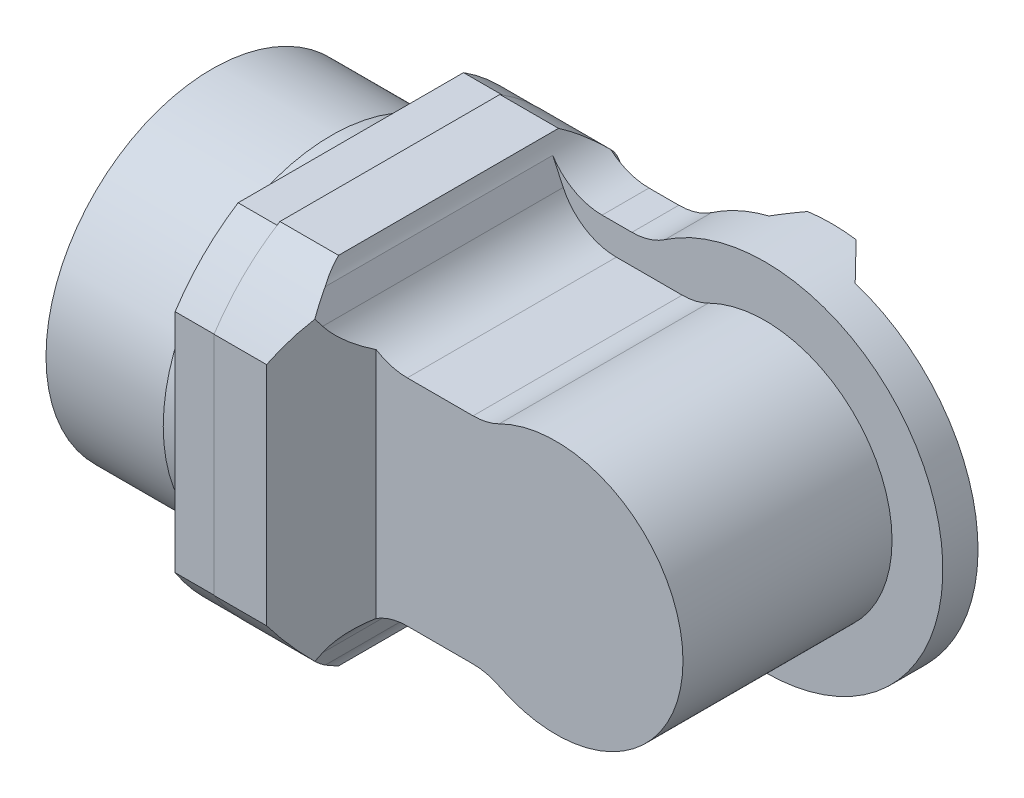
ISO-10303-21;
HEADER;
FILE_DESCRIPTION(('STEP AP214'),'2;1');
FILE_NAME('part.step','',(''),(''),'','','');
FILE_SCHEMA(('AUTOMOTIVE_DESIGN { 1 0 10303 214 1 1 1 1 }'));
ENDSEC;
DATA;
#1=APPLICATION_CONTEXT('core data for automotive mechanical design processes');
#2=APPLICATION_PROTOCOL_DEFINITION('international standard','automotive_design',2000,#1);
#3=PRODUCT_CONTEXT('',#1,'mechanical');
#4=PRODUCT('Part','Part','',(#3));
#5=PRODUCT_RELATED_PRODUCT_CATEGORY('part','',(#4));
#6=PRODUCT_DEFINITION_FORMATION('','',#4);
#7=PRODUCT_DEFINITION_CONTEXT('part definition',#1,'design');
#8=PRODUCT_DEFINITION('design','',#6,#7);
#9=PRODUCT_DEFINITION_SHAPE('','',#8);
#10=(LENGTH_UNIT() NAMED_UNIT(*) SI_UNIT(.MILLI.,.METRE.));
#11=(NAMED_UNIT(*) PLANE_ANGLE_UNIT() SI_UNIT($,.RADIAN.));
#12=(NAMED_UNIT(*) SI_UNIT($,.STERADIAN.) SOLID_ANGLE_UNIT());
#13=UNCERTAINTY_MEASURE_WITH_UNIT(LENGTH_MEASURE(1.E-05),#10,'distance_accuracy_value','');
#14=(GEOMETRIC_REPRESENTATION_CONTEXT(3) GLOBAL_UNCERTAINTY_ASSIGNED_CONTEXT((#13)) GLOBAL_UNIT_ASSIGNED_CONTEXT((#10,
#11,#12)) REPRESENTATION_CONTEXT('',''));
#15=CARTESIAN_POINT('',(0.,0.,0.));
#16=DIRECTION('',(0.,0.,1.));
#17=DIRECTION('',(1.,0.,0.));
#18=AXIS2_PLACEMENT_3D('',#15,#16,#17);
#19=CARTESIAN_POINT('',(-81.,0.,0.));
#20=DIRECTION('',(-1.,0.,0.));
#21=DIRECTION('',(0.,0.,1.));
#22=AXIS2_PLACEMENT_3D('',#19,#20,#21);
#23=PLANE('',#22);
#24=CARTESIAN_POINT('',(-81.,0.,0.));
#25=DIRECTION('',(-1.,0.,0.));
#26=DIRECTION('',(0.,0.,1.));
#27=AXIS2_PLACEMENT_3D('',#24,#25,#26);
#28=CIRCLE('',#27,43.);
#29=CARTESIAN_POINT('',(-81.,0.,43.));
#30=VERTEX_POINT('',#29);
#31=EDGE_CURVE('E326',#30,#30,#28,.T.);
#32=ORIENTED_EDGE('',*,*,#31,.F.);
#33=EDGE_LOOP('',(#32));
#34=FACE_BOUND('',#33,.T.);
#35=DIRECTION('',(0.,0.,-1.));
#36=VECTOR('',#35,1.);
#37=CARTESIAN_POINT('',(-81.,45.,-28.9352725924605));
#38=LINE('',#37,#36);
#39=CARTESIAN_POINT('',(-81.,45.,28.842720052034));
#40=VERTEX_POINT('',#39);
#41=CARTESIAN_POINT('',(-81.,45.,-28.842720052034));
#42=VERTEX_POINT('',#41);
#43=EDGE_CURVE('E344',#40,#42,#38,.T.);
#44=ORIENTED_EDGE('',*,*,#43,.T.);
#45=CARTESIAN_POINT('',(-81.,0.,0.));
#46=DIRECTION('',(-1.,0.,0.));
#47=DIRECTION('',(0.,0.,1.));
#48=AXIS2_PLACEMENT_3D('',#45,#46,#47);
#49=CIRCLE('',#48,53.45);
#50=CARTESIAN_POINT('',(-81.,28.842720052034,-45.));
#51=VERTEX_POINT('',#50);
#52=EDGE_CURVE('E827',#42,#51,#49,.T.);
#53=ORIENTED_EDGE('',*,*,#52,.T.);
#54=DIRECTION('',(0.,-1.,0.));
#55=VECTOR('',#54,1.);
#56=CARTESIAN_POINT('',(-81.,28.9352725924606,-45.));
#57=LINE('',#56,#55);
#58=CARTESIAN_POINT('',(-81.,-28.842720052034,-45.));
#59=VERTEX_POINT('',#58);
#60=EDGE_CURVE('E821',#51,#59,#57,.T.);
#61=ORIENTED_EDGE('',*,*,#60,.T.);
#62=CARTESIAN_POINT('',(-81.,-45.,-28.842720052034));
#63=VERTEX_POINT('',#62);
#64=EDGE_CURVE('E846',#59,#63,#49,.T.);
#65=ORIENTED_EDGE('',*,*,#64,.T.);
#66=DIRECTION('',(0.,0.,1.));
#67=VECTOR('',#66,1.);
#68=CARTESIAN_POINT('',(-81.,-45.,-28.9352725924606));
#69=LINE('',#68,#67);
#70=CARTESIAN_POINT('',(-81.,-45.,28.842720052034));
#71=VERTEX_POINT('',#70);
#72=EDGE_CURVE('E818',#63,#71,#69,.T.);
#73=ORIENTED_EDGE('',*,*,#72,.T.);
#74=CARTESIAN_POINT('',(-81.,-28.9205809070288,44.95));
#75=VERTEX_POINT('',#74);
#76=EDGE_CURVE('E301',#71,#75,#49,.T.);
#77=ORIENTED_EDGE('',*,*,#76,.T.);
#78=DIRECTION('',(0.,1.,0.));
#79=VECTOR('',#78,1.);
#80=CARTESIAN_POINT('',(-81.,28.9205809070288,44.95));
#81=LINE('',#80,#79);
#82=CARTESIAN_POINT('',(-81.,28.9205809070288,44.95));
#83=VERTEX_POINT('',#82);
#84=EDGE_CURVE('E290',#75,#83,#81,.T.);
#85=ORIENTED_EDGE('',*,*,#84,.T.);
#86=EDGE_CURVE('E292',#83,#40,#49,.T.);
#87=ORIENTED_EDGE('',*,*,#86,.T.);
#88=EDGE_LOOP('',(#44,#53,#61,#65,#73,#77,#85,#87));
#89=FACE_BOUND('',#88,.T.);
#90=ADVANCED_FACE('F16',(#34,#89),#23,.T.);
#91=CARTESIAN_POINT('',(-81.,45.,-28.9352725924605));
#92=DIRECTION('',(0.,-1.,0.));
#93=DIRECTION('',(0.,0.,-1.));
#94=AXIS2_PLACEMENT_3D('',#91,#92,#93);
#95=PLANE('',#94);
#96=DIRECTION('',(-1.,0.,0.));
#97=VECTOR('',#96,1.);
#98=CARTESIAN_POINT('',(101.490776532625,45.,28.842720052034));
#99=LINE('',#98,#97);
#100=CARTESIAN_POINT('',(-71.,45.,28.842720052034));
#101=VERTEX_POINT('',#100);
#102=EDGE_CURVE('E312',#101,#40,#99,.T.);
#103=ORIENTED_EDGE('',*,*,#102,.F.);
#104=DIRECTION('',(0.,0.,-1.));
#105=VECTOR('',#104,1.);
#106=CARTESIAN_POINT('',(-71.,45.,-28.9352725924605));
#107=LINE('',#106,#105);
#108=CARTESIAN_POINT('',(-71.,45.,-28.842720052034));
#109=VERTEX_POINT('',#108);
#110=EDGE_CURVE('E20',#101,#109,#107,.T.);
#111=ORIENTED_EDGE('',*,*,#110,.T.);
#112=DIRECTION('',(-1.,0.,0.));
#113=VECTOR('',#112,1.);
#114=CARTESIAN_POINT('',(101.490776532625,45.,-28.842720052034));
#115=LINE('',#114,#113);
#116=EDGE_CURVE('E310',#42,#109,#115,.F.);
#117=ORIENTED_EDGE('',*,*,#116,.F.);
#118=ORIENTED_EDGE('',*,*,#43,.F.);
#119=EDGE_LOOP('',(#103,#111,#117,#118));
#120=FACE_BOUND('',#119,.T.);
#121=ADVANCED_FACE('F520',(#120),#95,.F.);
#122=CARTESIAN_POINT('',(-81.,28.9352725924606,-45.));
#123=DIRECTION('',(0.,0.,1.));
#124=DIRECTION('',(1.,0.,0.));
#125=AXIS2_PLACEMENT_3D('',#122,#123,#124);
#126=PLANE('',#125);
#127=DIRECTION('',(-1.,0.,0.));
#128=VECTOR('',#127,1.);
#129=CARTESIAN_POINT('',(101.490776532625,28.842720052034,-45.));
#130=LINE('',#129,#128);
#131=CARTESIAN_POINT('',(-71.,28.842720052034,-45.));
#132=VERTEX_POINT('',#131);
#133=EDGE_CURVE('E308',#132,#51,#130,.T.);
#134=ORIENTED_EDGE('',*,*,#133,.F.);
#135=DIRECTION('',(0.,-1.,0.));
#136=VECTOR('',#135,1.);
#137=CARTESIAN_POINT('',(-71.,28.9352725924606,-45.));
#138=LINE('',#137,#136);
#139=CARTESIAN_POINT('',(-71.,-28.842720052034,-45.));
#140=VERTEX_POINT('',#139);
#141=EDGE_CURVE('E337',#132,#140,#138,.T.);
#142=ORIENTED_EDGE('',*,*,#141,.T.);
#143=DIRECTION('',(-1.,0.,0.));
#144=VECTOR('',#143,1.);
#145=CARTESIAN_POINT('',(101.490776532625,-28.842720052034,-45.));
#146=LINE('',#145,#144);
#147=EDGE_CURVE('E306',#59,#140,#146,.F.);
#148=ORIENTED_EDGE('',*,*,#147,.F.);
#149=ORIENTED_EDGE('',*,*,#60,.F.);
#150=EDGE_LOOP('',(#134,#142,#148,#149));
#151=FACE_BOUND('',#150,.T.);
#152=ADVANCED_FACE('F527',(#151),#126,.F.);
#153=CARTESIAN_POINT('',(-81.,-45.,-28.9352725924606));
#154=DIRECTION('',(0.,1.,0.));
#155=DIRECTION('',(0.,0.,1.));
#156=AXIS2_PLACEMENT_3D('',#153,#154,#155);
#157=PLANE('',#156);
#158=DIRECTION('',(-1.,0.,0.));
#159=VECTOR('',#158,1.);
#160=CARTESIAN_POINT('',(101.490776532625,-45.,-28.842720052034));
#161=LINE('',#160,#159);
#162=CARTESIAN_POINT('',(-71.,-45.,-28.842720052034));
#163=VERTEX_POINT('',#162);
#164=EDGE_CURVE('E10',#163,#63,#161,.T.);
#165=ORIENTED_EDGE('',*,*,#164,.F.);
#166=DIRECTION('',(0.,0.,1.));
#167=VECTOR('',#166,1.);
#168=CARTESIAN_POINT('',(-71.,-45.,-28.9352725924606));
#169=LINE('',#168,#167);
#170=CARTESIAN_POINT('',(-71.,-45.,28.842720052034));
#171=VERTEX_POINT('',#170);
#172=EDGE_CURVE('E339',#163,#171,#169,.T.);
#173=ORIENTED_EDGE('',*,*,#172,.T.);
#174=DIRECTION('',(-1.,0.,0.));
#175=VECTOR('',#174,1.);
#176=CARTESIAN_POINT('',(101.490776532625,-45.,28.842720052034));
#177=LINE('',#176,#175);
#178=EDGE_CURVE('E26',#71,#171,#177,.F.);
#179=ORIENTED_EDGE('',*,*,#178,.F.);
#180=ORIENTED_EDGE('',*,*,#72,.F.);
#181=EDGE_LOOP('',(#165,#173,#179,#180));
#182=FACE_BOUND('',#181,.T.);
#183=ADVANCED_FACE('F536',(#182),#157,.F.);
#184=CARTESIAN_POINT('',(-71.,0.,0.));
#185=DIRECTION('',(1.,0.,0.));
#186=DIRECTION('',(0.,0.,-1.));
#187=AXIS2_PLACEMENT_3D('',#184,#185,#186);
#188=PLANE('',#187);
#189=CARTESIAN_POINT('',(-71.,0.,0.));
#190=DIRECTION('',(-1.,0.,0.));
#191=DIRECTION('',(0.,0.,1.));
#192=AXIS2_PLACEMENT_3D('',#189,#190,#191);
#193=CIRCLE('',#192,53.5);
#194=CARTESIAN_POINT('',(-71.,45.5,-28.1424945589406));
#195=VERTEX_POINT('',#194);
#196=CARTESIAN_POINT('',(-71.,-45.5,-28.1424945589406));
#197=VERTEX_POINT('',#196);
#198=EDGE_CURVE('E345',#195,#197,#193,.T.);
#199=ORIENTED_EDGE('',*,*,#198,.T.);
#200=DIRECTION('',(0.,0.,-1.));
#201=VECTOR('',#200,1.);
#202=CARTESIAN_POINT('',(-71.,-45.5,0.));
#203=LINE('',#202,#201);
#204=CARTESIAN_POINT('',(-71.,-45.5,28.1424945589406));
#205=VERTEX_POINT('',#204);
#206=EDGE_CURVE('E415',#205,#197,#203,.T.);
#207=ORIENTED_EDGE('',*,*,#206,.F.);
#208=CARTESIAN_POINT('',(-71.,-28.9352725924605,45.));
#209=VERTEX_POINT('',#208);
#210=EDGE_CURVE('E360',#205,#209,#193,.T.);
#211=ORIENTED_EDGE('',*,*,#210,.T.);
#212=DIRECTION('',(0.,-1.,0.));
#213=VECTOR('',#212,1.);
#214=CARTESIAN_POINT('',(-71.,45.,45.));
#215=LINE('',#214,#213);
#216=CARTESIAN_POINT('',(-71.,28.9352725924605,45.));
#217=VERTEX_POINT('',#216);
#218=EDGE_CURVE('E303',#217,#209,#215,.T.);
#219=ORIENTED_EDGE('',*,*,#218,.F.);
#220=CARTESIAN_POINT('',(-71.,45.5,28.1424945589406));
#221=VERTEX_POINT('',#220);
#222=EDGE_CURVE('E349',#217,#221,#193,.T.);
#223=ORIENTED_EDGE('',*,*,#222,.T.);
#224=DIRECTION('',(0.,0.,1.));
#225=VECTOR('',#224,1.);
#226=CARTESIAN_POINT('',(-71.,45.5,0.));
#227=LINE('',#226,#225);
#228=EDGE_CURVE('E413',#195,#221,#227,.T.);
#229=ORIENTED_EDGE('',*,*,#228,.F.);
#230=EDGE_LOOP('',(#199,#207,#211,#219,#223,#229));
#231=FACE_BOUND('',#230,.T.);
#232=CARTESIAN_POINT('',(-71.,0.,0.));
#233=DIRECTION('',(1.,0.,0.));
#234=DIRECTION('',(0.,0.,-1.));
#235=AXIS2_PLACEMENT_3D('',#232,#233,#234);
#236=CIRCLE('',#235,53.45);
#237=CARTESIAN_POINT('',(-71.,-28.9205809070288,44.95));
#238=VERTEX_POINT('',#237);
#239=EDGE_CURVE('E34',#171,#238,#236,.F.);
#240=ORIENTED_EDGE('',*,*,#239,.F.);
#241=ORIENTED_EDGE('',*,*,#172,.F.);
#242=EDGE_CURVE('E282',#140,#163,#236,.F.);
#243=ORIENTED_EDGE('',*,*,#242,.F.);
#244=ORIENTED_EDGE('',*,*,#141,.F.);
#245=EDGE_CURVE('E836',#109,#132,#236,.F.);
#246=ORIENTED_EDGE('',*,*,#245,.F.);
#247=ORIENTED_EDGE('',*,*,#110,.F.);
#248=CARTESIAN_POINT('',(-71.,28.9205809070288,44.95));
#249=VERTEX_POINT('',#248);
#250=EDGE_CURVE('E285',#249,#101,#236,.F.);
#251=ORIENTED_EDGE('',*,*,#250,.F.);
#252=DIRECTION('',(0.,1.,0.));
#253=VECTOR('',#252,1.);
#254=CARTESIAN_POINT('',(-71.,28.9205809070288,44.95));
#255=LINE('',#254,#253);
#256=EDGE_CURVE('E283',#238,#249,#255,.T.);
#257=ORIENTED_EDGE('',*,*,#256,.F.);
#258=EDGE_LOOP('',(#240,#241,#243,#244,#246,#247,#251,#257));
#259=FACE_BOUND('',#258,.T.);
#260=ADVANCED_FACE('F18',(#231,#259),#188,.F.);
#261=CARTESIAN_POINT('',(-41.,0.,0.));
#262=DIRECTION('',(-1.,0.,0.));
#263=DIRECTION('',(0.,0.,1.));
#264=AXIS2_PLACEMENT_3D('',#261,#262,#263);
#265=CYLINDRICAL_SURFACE('',#264,53.5);
#266=DIRECTION('',(-1.,0.,0.));
#267=VECTOR('',#266,1.);
#268=CARTESIAN_POINT('',(-41.,-28.9352725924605,45.));
#269=LINE('',#268,#267);
#270=CARTESIAN_POINT('',(-57.5534243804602,-28.9352725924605,45.));
#271=VERTEX_POINT('',#270);
#272=EDGE_CURVE('E803',#209,#271,#269,.F.);
#273=ORIENTED_EDGE('',*,*,#272,.F.);
#274=ORIENTED_EDGE('',*,*,#210,.F.);
#275=DIRECTION('',(-1.,0.,0.));
#276=VECTOR('',#275,1.);
#277=CARTESIAN_POINT('',(-41.,-45.5,28.1424945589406));
#278=LINE('',#277,#276);
#279=CARTESIAN_POINT('',(-56.,-45.5,28.1424945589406));
#280=VERTEX_POINT('',#279);
#281=EDGE_CURVE('E639',#205,#280,#278,.F.);
#282=ORIENTED_EDGE('',*,*,#281,.T.);
#283=CARTESIAN_POINT('',(-56.,-45.5,28.1424945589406));
#284=CARTESIAN_POINT('',(-55.9486941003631,-45.3368762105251,28.4062321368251));
#285=CARTESIAN_POINT('',(-55.89371488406,-45.1717815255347,28.668021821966));
#286=CARTESIAN_POINT('',(-55.7757989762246,-44.8378931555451,29.1874745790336));
#287=CARTESIAN_POINT('',(-55.7128610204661,-44.6690988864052,29.4451369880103));
#288=CARTESIAN_POINT('',(-55.5109680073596,-44.1569742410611,30.2124142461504));
#289=CARTESIAN_POINT('',(-55.3591205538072,-43.8085122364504,30.7153336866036));
#290=CARTESIAN_POINT('',(-55.0141959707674,-43.0972390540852,31.7057400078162));
#291=CARTESIAN_POINT('',(-54.8206705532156,-42.7343099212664,32.19298701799));
#292=CARTESIAN_POINT('',(-54.3882561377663,-42.0026378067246,33.1419170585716));
#293=CARTESIAN_POINT('',(-54.1494065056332,-41.6339001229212,33.6036218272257));
#294=CARTESIAN_POINT('',(-53.697173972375,-41.0025541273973,34.368753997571));
#295=CARTESIAN_POINT('',(-53.4962137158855,-40.7399139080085,34.6795215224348));
#296=CARTESIAN_POINT('',(-53.0669559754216,-40.2173654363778,35.2841756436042));
#297=CARTESIAN_POINT('',(-52.83865706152,-39.957457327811,35.5780613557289));
#298=CARTESIAN_POINT('',(-52.3543475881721,-39.4446690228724,36.1457306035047));
#299=CARTESIAN_POINT('',(-52.0984516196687,-39.1917648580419,36.4195899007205));
#300=CARTESIAN_POINT('',(-51.5573112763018,-38.6956278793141,36.9463017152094));
#301=CARTESIAN_POINT('',(-51.2720722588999,-38.4523933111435,37.1991580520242));
#302=CARTESIAN_POINT('',(-50.7202237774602,-38.0177513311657,37.642808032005));
#303=CARTESIAN_POINT('',(-50.4579905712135,-37.8242981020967,37.8370442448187));
#304=CARTESIAN_POINT('',(-49.9129403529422,-37.4497995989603,38.2077466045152));
#305=CARTESIAN_POINT('',(-49.630127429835,-37.2687518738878,38.384216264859));
#306=CARTESIAN_POINT('',(-49.0443000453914,-36.9216321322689,38.7182280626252));
#307=CARTESIAN_POINT('',(-48.7412659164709,-36.7555750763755,38.8757513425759));
#308=CARTESIAN_POINT('',(-48.1164775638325,-36.4414476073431,39.1703623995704));
#309=CARTESIAN_POINT('',(-47.7947237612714,-36.2933767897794,39.3074506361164));
#310=CARTESIAN_POINT('',(-47.1317831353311,-36.0169084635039,39.5609375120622));
#311=CARTESIAN_POINT('',(-46.7904686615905,-35.8886668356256,39.6771732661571));
#312=CARTESIAN_POINT('',(-46.0929418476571,-35.6557563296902,39.8866094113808));
#313=CARTESIAN_POINT('',(-45.7367271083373,-35.5510912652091,39.9798060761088));
#314=CARTESIAN_POINT('',(-45.0130845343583,-35.3677678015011,40.1420725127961));
#315=CARTESIAN_POINT('',(-44.6456803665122,-35.2890581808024,40.2111898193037));
#316=CARTESIAN_POINT('',(-43.9024988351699,-35.1591436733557,40.3248322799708));
#317=CARTESIAN_POINT('',(-43.5267273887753,-35.1079199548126,40.3693742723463));
#318=CARTESIAN_POINT('',(-42.9067780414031,-35.0473830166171,40.4219235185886));
#319=CARTESIAN_POINT('',(-42.6639982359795,-35.0296180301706,40.4373129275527));
#320=CARTESIAN_POINT('',(-42.1777956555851,-35.0059282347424,40.4578183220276));
#321=CARTESIAN_POINT('',(-41.9343743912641,-34.9999857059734,40.4629496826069));
#322=CARTESIAN_POINT('',(-41.6909119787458,-35.,40.4629460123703));
#323=B_SPLINE_CURVE_WITH_KNOTS('',3,(#283,#284,#285,#286,#287,#288,#289,#290,#291,#292,#293,
#294,#295,#296,#297,#298,#299,#300,#301,#302,#303,#304,#305,#306,#307,#308,#309,#310,#311,#312,
#313,#314,#315,#316,#317,#318,#319,#320,#321,#322),.UNSPECIFIED.,.F.,.F.,(4,2,2,2,2,2,2,2,2,2,2,
2,2,2,2,2,2,2,2,4),(0.,0.94290375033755,1.88595746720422,3.77558062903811,5.68664564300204,
7.59605836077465,8.956482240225,10.3169773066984,11.6720261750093,13.0268280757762,
14.1638414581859,15.3006295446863,16.4385398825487,17.5764246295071,18.7228436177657,
19.8694479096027,21.0137757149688,22.1573184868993,22.8885958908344,23.6187764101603),.UNSPECIFIED.);
#324=CARTESIAN_POINT('',(-54.3358164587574,-41.9311468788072,33.2269306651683));
#325=VERTEX_POINT('',#324);
#326=EDGE_CURVE('E477',#280,#325,#323,.T.);
#327=ORIENTED_EDGE('',*,*,#326,.T.);
#328=CARTESIAN_POINT('',(-34.7830015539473,0.,0.));
#329=DIRECTION('',(-0.906307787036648,0.422618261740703,0.));
#330=DIRECTION('',(-0.422618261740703,-0.906307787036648,0.));
#331=AXIS2_PLACEMENT_3D('',#328,#329,#330);
#332=ELLIPSE('',#331,59.0307186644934,53.5);
#333=CARTESIAN_POINT('',(-52.4672525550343,-37.9239986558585,37.73619384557));
#334=VERTEX_POINT('',#333);
#335=EDGE_CURVE('E728',#334,#325,#332,.F.);
#336=ORIENTED_EDGE('',*,*,#335,.F.);
#337=CARTESIAN_POINT('',(-26.0440851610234,0.,0.));
#338=DIRECTION('',(-0.819152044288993,0.,-0.573576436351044));
#339=DIRECTION('',(-0.573576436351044,0.,0.819152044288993));
#340=AXIS2_PLACEMENT_3D('',#337,#338,#339);
#341=ELLIPSE('',#340,65.3114404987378,53.5);
#342=EDGE_CURVE('E763',#271,#334,#341,.F.);
#343=ORIENTED_EDGE('',*,*,#342,.F.);
#344=EDGE_LOOP('',(#273,#274,#282,#327,#336,#343));
#345=FACE_BOUND('',#344,.T.);
#346=ADVANCED_FACE('F518',(#345),#265,.T.);
#347=CARTESIAN_POINT('',(-41.6909119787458,35.,-50.));
#348=DIRECTION('',(0.,1.,0.));
#349=DIRECTION('',(0.,0.,1.));
#350=AXIS2_PLACEMENT_3D('',#347,#348,#349);
#351=PLANE('',#350);
#352=DIRECTION('',(0.,0.,1.));
#353=VECTOR('',#352,1.);
#354=CARTESIAN_POINT('',(-41.6909119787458,35.,-50.));
#355=LINE('',#354,#353);
#356=CARTESIAN_POINT('',(-41.6909119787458,35.,-37.));
#357=VERTEX_POINT('',#356);
#358=CARTESIAN_POINT('',(-41.6909119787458,35.,-25.));
#359=VERTEX_POINT('',#358);
#360=EDGE_CURVE('E741',#357,#359,#355,.T.);
#361=ORIENTED_EDGE('',*,*,#360,.T.);
#362=DIRECTION('',(1.,0.,0.));
#363=VECTOR('',#362,1.);
#364=CARTESIAN_POINT('',(-41.6909119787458,35.,-25.));
#365=LINE('',#364,#363);
#366=CARTESIAN_POINT('',(-34.0624426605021,35.,-25.));
#367=VERTEX_POINT('',#366);
#368=EDGE_CURVE('E719',#359,#367,#365,.T.);
#369=ORIENTED_EDGE('',*,*,#368,.T.);
#370=DIRECTION('',(0.,0.,1.));
#371=VECTOR('',#370,1.);
#372=CARTESIAN_POINT('',(-34.0624426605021,35.,-50.));
#373=LINE('',#372,#371);
#374=CARTESIAN_POINT('',(-34.0624426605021,35.,-37.));
#375=VERTEX_POINT('',#374);
#376=EDGE_CURVE('E464',#375,#367,#373,.T.);
#377=ORIENTED_EDGE('',*,*,#376,.F.);
#378=DIRECTION('',(-1.,0.,0.));
#379=VECTOR('',#378,1.);
#380=CARTESIAN_POINT('',(-46.,35.,-37.));
#381=LINE('',#380,#379);
#382=EDGE_CURVE('E419',#375,#357,#381,.T.);
#383=ORIENTED_EDGE('',*,*,#382,.T.);
#384=EDGE_LOOP('',(#361,#369,#377,#383));
#385=FACE_BOUND('',#384,.T.);
#386=ADVANCED_FACE('F622',(#385),#351,.T.);
#387=CARTESIAN_POINT('',(-34.0624426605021,50.,-50.));
#388=DIRECTION('',(0.,0.,1.));
#389=DIRECTION('',(1.,0.,0.));
#390=AXIS2_PLACEMENT_3D('',#387,#388,#389);
#391=CYLINDRICAL_SURFACE('',#390,15.);
#392=ORIENTED_EDGE('',*,*,#376,.T.);
#393=CARTESIAN_POINT('',(-34.0624426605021,50.,-25.));
#394=DIRECTION('',(0.,0.,1.));
#395=DIRECTION('',(1.,0.,0.));
#396=AXIS2_PLACEMENT_3D('',#393,#394,#395);
#397=CIRCLE('',#396,15.);
#398=CARTESIAN_POINT('',(-25.6172089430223,37.603305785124,-25.));
#399=VERTEX_POINT('',#398);
#400=EDGE_CURVE('E716',#367,#399,#397,.T.);
#401=ORIENTED_EDGE('',*,*,#400,.T.);
#402=DIRECTION('',(0.,0.,1.));
#403=VECTOR('',#402,1.);
#404=CARTESIAN_POINT('',(-25.6172089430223,37.603305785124,-50.));
#405=LINE('',#404,#403);
#406=CARTESIAN_POINT('',(-25.6172089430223,37.603305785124,-37.));
#407=VERTEX_POINT('',#406);
#408=EDGE_CURVE('E462',#407,#399,#405,.T.);
#409=ORIENTED_EDGE('',*,*,#408,.F.);
#410=CARTESIAN_POINT('',(-34.0624426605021,50.,-37.));
#411=DIRECTION('',(0.,0.,1.));
#412=DIRECTION('',(1.,0.,0.));
#413=AXIS2_PLACEMENT_3D('',#410,#411,#412);
#414=CIRCLE('',#413,15.);
#415=EDGE_CURVE('E421',#407,#375,#414,.F.);
#416=ORIENTED_EDGE('',*,*,#415,.T.);
#417=EDGE_LOOP('',(#392,#401,#409,#416));
#418=FACE_BOUND('',#417,.T.);
#419=ADVANCED_FACE('F746',(#418),#391,.F.);
#420=CARTESIAN_POINT('',(0.,0.,-50.));
#421=DIRECTION('',(0.,0.,1.));
#422=DIRECTION('',(1.,0.,0.));
#423=AXIS2_PLACEMENT_3D('',#420,#421,#422);
#424=CYLINDRICAL_SURFACE('',#423,45.5);
#425=CARTESIAN_POINT('',(0.,0.,-37.));
#426=DIRECTION('',(0.,0.,1.));
#427=DIRECTION('',(1.,0.,0.));
#428=AXIS2_PLACEMENT_3D('',#425,#426,#427);
#429=CIRCLE('',#428,45.5);
#430=CARTESIAN_POINT('',(-25.6172089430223,-37.603305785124,-37.));
#431=VERTEX_POINT('',#430);
#432=CARTESIAN_POINT('',(-16.8828473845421,-42.2518575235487,-37.));
#433=VERTEX_POINT('',#432);
#434=EDGE_CURVE('E423',#431,#433,#429,.T.);
#435=ORIENTED_EDGE('',*,*,#434,.T.);
#436=CARTESIAN_POINT('',(0.,0.,-34.));
#437=DIRECTION('',(-0.672498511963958,0.218508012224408,0.707106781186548));
#438=DIRECTION('',(0.672498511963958,-0.218508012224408,0.707106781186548));
#439=AXIS2_PLACEMENT_3D('',#436,#437,#438);
#440=ELLIPSE('',#439,64.3467170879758,45.5);
#441=CARTESIAN_POINT('',(-14.0602732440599,-43.2730714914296,-34.));
#442=VERTEX_POINT('',#441);
#443=EDGE_CURVE('E342',#433,#442,#440,.T.);
#444=ORIENTED_EDGE('',*,*,#443,.T.);
#445=CARTESIAN_POINT('',(0.,0.,-34.));
#446=DIRECTION('',(0.,0.,-1.));
#447=DIRECTION('',(0.,1.,0.));
#448=AXIS2_PLACEMENT_3D('',#445,#446,#447);
#449=CIRCLE('',#448,45.5);
#450=CARTESIAN_POINT('',(14.0602732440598,43.2730714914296,-34.));
#451=VERTEX_POINT('',#450);
#452=EDGE_CURVE('E815',#451,#442,#449,.T.);
#453=ORIENTED_EDGE('',*,*,#452,.F.);
#454=CARTESIAN_POINT('',(0.,0.,-34.));
#455=DIRECTION('',(-0.672498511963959,0.218508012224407,0.707106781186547));
#456=DIRECTION('',(0.672498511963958,-0.218508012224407,0.707106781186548));
#457=AXIS2_PLACEMENT_3D('',#454,#455,#456);
#458=ELLIPSE('',#457,64.3467170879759,45.5);
#459=CARTESIAN_POINT('',(6.23278435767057,45.0710816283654,-42.));
#460=VERTEX_POINT('',#459);
#461=EDGE_CURVE('E366',#451,#460,#458,.T.);
#462=ORIENTED_EDGE('',*,*,#461,.T.);
#463=CARTESIAN_POINT('',(0.,0.,-42.));
#464=DIRECTION('',(0.,0.,-1.));
#465=DIRECTION('',(0.,-1.,0.));
#466=AXIS2_PLACEMENT_3D('',#463,#464,#465);
#467=CIRCLE('',#466,45.5);
#468=CARTESIAN_POINT('',(-6.08930369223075,45.0906906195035,-42.));
#469=VERTEX_POINT('',#468);
#470=EDGE_CURVE('E736',#469,#460,#467,.T.);
#471=ORIENTED_EDGE('',*,*,#470,.F.);
#472=CARTESIAN_POINT('',(0.,0.,-37.));
#473=DIRECTION('',(0.686102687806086,0.171064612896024,0.707106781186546));
#474=DIRECTION('',(-0.686102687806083,-0.171064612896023,0.707106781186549));
#475=AXIS2_PLACEMENT_3D('',#472,#473,#474);
#476=ELLIPSE('',#475,64.3467170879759,45.5);
#477=CARTESIAN_POINT('',(-11.0074462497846,44.1484555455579,-37.));
#478=VERTEX_POINT('',#477);
#479=EDGE_CURVE('E376',#469,#478,#476,.T.);
#480=ORIENTED_EDGE('',*,*,#479,.T.);
#481=EDGE_CURVE('E425',#478,#407,#429,.T.);
#482=ORIENTED_EDGE('',*,*,#481,.T.);
#483=ORIENTED_EDGE('',*,*,#408,.T.);
#484=CARTESIAN_POINT('',(0.,0.,-25.));
#485=DIRECTION('',(0.,0.,1.));
#486=DIRECTION('',(1.,0.,0.));
#487=AXIS2_PLACEMENT_3D('',#484,#485,#486);
#488=CIRCLE('',#487,45.5);
#489=CARTESIAN_POINT('',(-25.6172089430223,-37.603305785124,-25.));
#490=VERTEX_POINT('',#489);
#491=EDGE_CURVE('E461',#399,#490,#488,.F.);
#492=ORIENTED_EDGE('',*,*,#491,.T.);
#493=DIRECTION('',(0.,0.,1.));
#494=VECTOR('',#493,1.);
#495=CARTESIAN_POINT('',(-25.6172089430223,-37.603305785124,-50.));
#496=LINE('',#495,#494);
#497=EDGE_CURVE('E455',#431,#490,#496,.T.);
#498=ORIENTED_EDGE('',*,*,#497,.F.);
#499=EDGE_LOOP('',(#435,#444,#453,#462,#471,#480,#482,#483,#492,#498));
#500=FACE_BOUND('',#499,.T.);
#501=ADVANCED_FACE('F458',(#500),#424,.T.);
#502=CARTESIAN_POINT('',(-34.0624426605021,-50.,-50.));
#503=DIRECTION('',(0.,0.,1.));
#504=DIRECTION('',(1.,0.,0.));
#505=AXIS2_PLACEMENT_3D('',#502,#503,#504);
#506=CYLINDRICAL_SURFACE('',#505,15.);
#507=ORIENTED_EDGE('',*,*,#497,.T.);
#508=CARTESIAN_POINT('',(-34.0624426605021,-50.,-25.));
#509=DIRECTION('',(0.,0.,1.));
#510=DIRECTION('',(1.,0.,0.));
#511=AXIS2_PLACEMENT_3D('',#508,#509,#510);
#512=CIRCLE('',#511,15.);
#513=CARTESIAN_POINT('',(-34.0624426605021,-35.,-25.));
#514=VERTEX_POINT('',#513);
#515=EDGE_CURVE('E713',#490,#514,#512,.T.);
#516=ORIENTED_EDGE('',*,*,#515,.T.);
#517=DIRECTION('',(0.,0.,1.));
#518=VECTOR('',#517,1.);
#519=CARTESIAN_POINT('',(-34.0624426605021,-35.,-50.));
#520=LINE('',#519,#518);
#521=CARTESIAN_POINT('',(-34.0624426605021,-35.,-37.));
#522=VERTEX_POINT('',#521);
#523=EDGE_CURVE('E445',#522,#514,#520,.T.);
#524=ORIENTED_EDGE('',*,*,#523,.F.);
#525=CARTESIAN_POINT('',(-34.0624426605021,-50.,-37.));
#526=DIRECTION('',(0.,0.,1.));
#527=DIRECTION('',(1.,0.,0.));
#528=AXIS2_PLACEMENT_3D('',#525,#526,#527);
#529=CIRCLE('',#528,15.);
#530=EDGE_CURVE('E426',#522,#431,#529,.F.);
#531=ORIENTED_EDGE('',*,*,#530,.T.);
#532=EDGE_LOOP('',(#507,#516,#524,#531));
#533=FACE_BOUND('',#532,.T.);
#534=ADVANCED_FACE('F453',(#533),#506,.F.);
#535=CARTESIAN_POINT('',(-41.6909119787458,-35.,-50.));
#536=DIRECTION('',(0.,-1.,0.));
#537=DIRECTION('',(0.,0.,-1.));
#538=AXIS2_PLACEMENT_3D('',#535,#536,#537);
#539=PLANE('',#538);
#540=ORIENTED_EDGE('',*,*,#523,.T.);
#541=DIRECTION('',(-1.,0.,0.));
#542=VECTOR('',#541,1.);
#543=CARTESIAN_POINT('',(-41.6909119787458,-35.,-25.));
#544=LINE('',#543,#542);
#545=CARTESIAN_POINT('',(-41.6909119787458,-35.,-25.));
#546=VERTEX_POINT('',#545);
#547=EDGE_CURVE('E444',#514,#546,#544,.T.);
#548=ORIENTED_EDGE('',*,*,#547,.T.);
#549=DIRECTION('',(0.,0.,1.));
#550=VECTOR('',#549,1.);
#551=CARTESIAN_POINT('',(-41.6909119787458,-35.,-50.));
#552=LINE('',#551,#550);
#553=CARTESIAN_POINT('',(-41.6909119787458,-35.,-37.));
#554=VERTEX_POINT('',#553);
#555=EDGE_CURVE('E438',#554,#546,#552,.T.);
#556=ORIENTED_EDGE('',*,*,#555,.F.);
#557=DIRECTION('',(1.,0.,0.));
#558=VECTOR('',#557,1.);
#559=CARTESIAN_POINT('',(-46.,-35.,-37.));
#560=LINE('',#559,#558);
#561=EDGE_CURVE('E427',#554,#522,#560,.T.);
#562=ORIENTED_EDGE('',*,*,#561,.T.);
#563=EDGE_LOOP('',(#540,#548,#556,#562));
#564=FACE_BOUND('',#563,.T.);
#565=ADVANCED_FACE('F443',(#564),#539,.T.);
#566=CARTESIAN_POINT('',(-46.,119.1,-37.));
#567=DIRECTION('',(0.,0.,1.));
#568=DIRECTION('',(1.,0.,0.));
#569=AXIS2_PLACEMENT_3D('',#566,#567,#568);
#570=PLANE('',#569);
#571=CARTESIAN_POINT('',(0.,0.,-37.));
#572=DIRECTION('',(0.,0.,-1.));
#573=DIRECTION('',(-1.,0.,0.));
#574=AXIS2_PLACEMENT_3D('',#571,#572,#573);
#575=CIRCLE('',#574,43.5);
#576=CARTESIAN_POINT('',(-16.263403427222,-40.345405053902,-37.));
#577=VERTEX_POINT('',#576);
#578=CARTESIAN_POINT('',(-10.5236024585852,42.2078640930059,-37.));
#579=VERTEX_POINT('',#578);
#580=EDGE_CURVE('E648',#577,#579,#575,.T.);
#581=ORIENTED_EDGE('',*,*,#580,.F.);
#582=DIRECTION('',(-0.309016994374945,-0.951056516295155,0.));
#583=VECTOR('',#582,1.);
#584=CARTESIAN_POINT('',(27.7568330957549,95.1349521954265,-37.));
#585=LINE('',#584,#583);
#586=EDGE_CURVE('E42',#577,#433,#585,.T.);
#587=ORIENTED_EDGE('',*,*,#586,.T.);
#588=ORIENTED_EDGE('',*,*,#434,.F.);
#589=ORIENTED_EDGE('',*,*,#530,.F.);
#590=ORIENTED_EDGE('',*,*,#561,.F.);
#591=CARTESIAN_POINT('',(-41.6909119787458,-50.,-37.));
#592=DIRECTION('',(0.,0.,1.));
#593=DIRECTION('',(1.,0.,0.));
#594=AXIS2_PLACEMENT_3D('',#591,#592,#593);
#595=CIRCLE('',#594,15.);
#596=CARTESIAN_POINT('',(-51.4465756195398,-38.6058336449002,-37.));
#597=VERTEX_POINT('',#596);
#598=EDGE_CURVE('E356',#597,#554,#595,.F.);
#599=ORIENTED_EDGE('',*,*,#598,.F.);
#600=DIRECTION('',(0.,1.,0.));
#601=VECTOR('',#600,1.);
#602=CARTESIAN_POINT('',(-51.4465756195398,-104.8,-37.));
#603=LINE('',#602,#601);
#604=CARTESIAN_POINT('',(-51.4465756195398,38.6058336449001,-37.));
#605=VERTEX_POINT('',#604);
#606=EDGE_CURVE('E754',#597,#605,#603,.T.);
#607=ORIENTED_EDGE('',*,*,#606,.T.);
#608=CARTESIAN_POINT('',(-41.6909119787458,50.,-37.));
#609=DIRECTION('',(0.,0.,1.));
#610=DIRECTION('',(1.,0.,0.));
#611=AXIS2_PLACEMENT_3D('',#608,#609,#610);
#612=CIRCLE('',#611,15.);
#613=EDGE_CURVE('E417',#357,#605,#612,.F.);
#614=ORIENTED_EDGE('',*,*,#613,.F.);
#615=ORIENTED_EDGE('',*,*,#382,.F.);
#616=ORIENTED_EDGE('',*,*,#415,.F.);
#617=ORIENTED_EDGE('',*,*,#481,.F.);
#618=DIRECTION('',(-0.24192189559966,0.970295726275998,0.));
#619=VECTOR('',#618,1.);
#620=CARTESIAN_POINT('',(-11.0074462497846,44.1484555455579,-37.));
#621=LINE('',#620,#619);
#622=EDGE_CURVE('E733',#579,#478,#621,.T.);
#623=ORIENTED_EDGE('',*,*,#622,.F.);
#624=EDGE_LOOP('',(#581,#587,#588,#589,#590,#599,#607,#614,#615,#616,#617,#623));
#625=FACE_BOUND('',#624,.T.);
#626=ADVANCED_FACE('F449',(#625),#570,.F.);
#627=ORIENTED_EDGE('',*,*,#222,.F.);
#628=DIRECTION('',(-1.,0.,0.));
#629=VECTOR('',#628,1.);
#630=CARTESIAN_POINT('',(-41.,28.9352725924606,45.));
#631=LINE('',#630,#629);
#632=CARTESIAN_POINT('',(-57.5534243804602,28.9352725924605,45.));
#633=VERTEX_POINT('',#632);
#634=EDGE_CURVE('E802',#633,#217,#631,.T.);
#635=ORIENTED_EDGE('',*,*,#634,.F.);
#636=CARTESIAN_POINT('',(-52.4672525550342,37.9239986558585,37.73619384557));
#637=VERTEX_POINT('',#636);
#638=EDGE_CURVE('E668',#637,#633,#341,.F.);
#639=ORIENTED_EDGE('',*,*,#638,.F.);
#640=CARTESIAN_POINT('',(-34.7830015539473,0.,0.));
#641=DIRECTION('',(-0.906307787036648,-0.422618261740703,0.));
#642=DIRECTION('',(-0.422618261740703,0.906307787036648,0.));
#643=AXIS2_PLACEMENT_3D('',#640,#641,#642);
#644=ELLIPSE('',#643,59.0307186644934,53.5);
#645=CARTESIAN_POINT('',(-54.3358164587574,41.9311468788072,33.2269306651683));
#646=VERTEX_POINT('',#645);
#647=EDGE_CURVE('E730',#646,#637,#644,.F.);
#648=ORIENTED_EDGE('',*,*,#647,.F.);
#649=CARTESIAN_POINT('',(-41.6909119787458,35.,40.4629460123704));
#650=CARTESIAN_POINT('',(-41.8605177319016,34.9999981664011,40.4629458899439));
#651=CARTESIAN_POINT('',(-42.0301001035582,35.0028773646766,40.4604573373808));
#652=CARTESIAN_POINT('',(-42.3689177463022,35.0143723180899,40.4505106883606));
#653=CARTESIAN_POINT('',(-42.538153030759,35.0229878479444,40.443052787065));
#654=CARTESIAN_POINT('',(-43.0447080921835,35.0573874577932,40.4132474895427));
#655=CARTESIAN_POINT('',(-43.3810782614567,35.0917246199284,40.383468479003));
#656=CARTESIAN_POINT('',(-44.0467499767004,35.182363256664,40.3045267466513));
#657=CARTESIAN_POINT('',(-44.3760783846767,35.2385544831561,40.2554613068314));
#658=CARTESIAN_POINT('',(-45.0270296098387,35.371921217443,40.1383240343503));
#659=CARTESIAN_POINT('',(-45.3486520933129,35.4490976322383,40.0702513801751));
#660=CARTESIAN_POINT('',(-45.98161986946,35.6230235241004,39.9157073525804));
#661=CARTESIAN_POINT('',(-46.2929757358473,35.7197520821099,39.8292556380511));
#662=CARTESIAN_POINT('',(-46.9038902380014,35.9312629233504,39.6385494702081));
#663=CARTESIAN_POINT('',(-47.2034477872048,36.0460468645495,39.5342933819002));
#664=CARTESIAN_POINT('',(-47.7893591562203,36.2919742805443,39.3086561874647));
#665=CARTESIAN_POINT('',(-48.0757031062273,36.4231297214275,39.187262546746));
#666=CARTESIAN_POINT('',(-48.6337035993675,36.699825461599,38.9282507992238));
#667=CARTESIAN_POINT('',(-48.9053597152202,36.8453661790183,38.7906322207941));
#668=CARTESIAN_POINT('',(-49.4450993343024,37.1557846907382,38.4934525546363));
#669=CARTESIAN_POINT('',(-49.7124556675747,37.3212414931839,38.3331772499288));
#670=CARTESIAN_POINT('',(-50.2295303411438,37.6635424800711,37.996909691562));
#671=CARTESIAN_POINT('',(-50.479242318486,37.8403907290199,37.8209118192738));
#672=CARTESIAN_POINT('',(-50.9605619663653,38.2032041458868,37.4543940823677));
#673=CARTESIAN_POINT('',(-51.1921744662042,38.3891668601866,37.2638781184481));
#674=CARTESIAN_POINT('',(-51.6374093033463,38.7682273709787,36.8693567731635));
#675=CARTESIAN_POINT('',(-51.8510277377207,38.9613267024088,36.6653484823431));
#676=CARTESIAN_POINT('',(-52.3701583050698,39.4575714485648,36.13231491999));
#677=CARTESIAN_POINT('',(-52.6636416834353,39.7642870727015,35.794831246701));
#678=CARTESIAN_POINT('',(-53.2106336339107,40.3840220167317,35.0941562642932));
#679=CARTESIAN_POINT('',(-53.4641230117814,40.6970442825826,34.7309527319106));
#680=CARTESIAN_POINT('',(-53.9345003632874,41.3253766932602,33.980927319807));
#681=CARTESIAN_POINT('',(-54.1512583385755,41.6406910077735,33.5940278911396));
#682=CARTESIAN_POINT('',(-54.5501615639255,42.2683779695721,32.8007621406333));
#683=CARTESIAN_POINT('',(-54.7323140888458,42.5807512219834,32.3943999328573));
#684=CARTESIAN_POINT('',(-55.0212399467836,43.1174826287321,31.6745578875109));
#685=CARTESIAN_POINT('',(-55.1352028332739,43.3432493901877,31.3649678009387));
#686=CARTESIAN_POINT('',(-55.3475273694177,43.7904815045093,30.7374712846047));
#687=CARTESIAN_POINT('',(-55.4458898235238,44.0119470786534,30.4195652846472));
#688=CARTESIAN_POINT('',(-55.62752866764,44.4478798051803,29.7789317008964));
#689=CARTESIAN_POINT('',(-55.7109252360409,44.6623902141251,29.4562673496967));
#690=CARTESIAN_POINT('',(-55.8648251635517,45.0856581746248,28.804249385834));
#691=CARTESIAN_POINT('',(-55.9353311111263,45.2944168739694,28.474897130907));
#692=CARTESIAN_POINT('',(-56.,45.5,28.1424945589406));
#693=B_SPLINE_CURVE_WITH_KNOTS('',3,(#649,#650,#651,#652,#653,#654,#655,#656,#657,#658,#659,
#660,#661,#662,#663,#664,#665,#666,#667,#668,#669,#670,#671,#672,#673,#674,#675,#676,#677,#678,
#679,#680,#681,#682,#683,#684,#685,#686,#687,#688,#689,#690,#691,#692),.UNSPECIFIED.,.F.,.F.,(4,
2,2,2,2,2,2,2,2,2,2,2,2,2,2,2,2,2,2,2,2,4),(0.,0.508728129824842,1.01743628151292,
2.03425121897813,3.04600176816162,4.05779605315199,5.06851348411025,6.07932378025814,
7.09087726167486,8.10246015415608,9.16014938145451,10.2182181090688,11.2760035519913,
12.3340178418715,13.9584484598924,15.5836563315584,17.2145011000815,18.845002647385,
20.043863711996,21.2426629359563,22.4313569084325,23.6198119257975),.UNSPECIFIED.);
#694=CARTESIAN_POINT('',(-56.,45.5,28.1424945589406));
#695=VERTEX_POINT('',#694);
#696=EDGE_CURVE('E630',#646,#695,#693,.T.);
#697=ORIENTED_EDGE('',*,*,#696,.T.);
#698=DIRECTION('',(-1.,0.,0.));
#699=VECTOR('',#698,1.);
#700=CARTESIAN_POINT('',(-41.,45.5,28.1424945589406));
#701=LINE('',#700,#699);
#702=EDGE_CURVE('E642',#695,#221,#701,.T.);
#703=ORIENTED_EDGE('',*,*,#702,.T.);
#704=EDGE_LOOP('',(#627,#635,#639,#648,#697,#703));
#705=FACE_BOUND('',#704,.T.);
#706=ADVANCED_FACE('F483',(#705),#265,.T.);
#707=DIRECTION('',(-1.,0.,0.));
#708=VECTOR('',#707,1.);
#709=CARTESIAN_POINT('',(-41.,-45.5,-28.1424945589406));
#710=LINE('',#709,#708);
#711=CARTESIAN_POINT('',(-56.,-45.5,-28.1424945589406));
#712=VERTEX_POINT('',#711);
#713=EDGE_CURVE('E636',#712,#197,#710,.T.);
#714=ORIENTED_EDGE('',*,*,#713,.T.);
#715=ORIENTED_EDGE('',*,*,#198,.F.);
#716=DIRECTION('',(-1.,0.,0.));
#717=VECTOR('',#716,1.);
#718=CARTESIAN_POINT('',(-41.,45.5,-28.1424945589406));
#719=LINE('',#718,#717);
#720=CARTESIAN_POINT('',(-56.,45.5,-28.1424945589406));
#721=VERTEX_POINT('',#720);
#722=EDGE_CURVE('E645',#195,#721,#719,.F.);
#723=ORIENTED_EDGE('',*,*,#722,.T.);
#724=CARTESIAN_POINT('',(-56.,45.5,-28.1424945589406));
#725=CARTESIAN_POINT('',(-55.9486941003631,45.3368762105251,-28.4062321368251));
#726=CARTESIAN_POINT('',(-55.89371488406,45.1717815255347,-28.668021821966));
#727=CARTESIAN_POINT('',(-55.7757989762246,44.8378931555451,-29.1874745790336));
#728=CARTESIAN_POINT('',(-55.7128610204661,44.6690988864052,-29.4451369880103));
#729=CARTESIAN_POINT('',(-55.5109680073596,44.1569742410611,-30.2124142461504));
#730=CARTESIAN_POINT('',(-55.3591205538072,43.8085122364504,-30.7153336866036));
#731=CARTESIAN_POINT('',(-55.0141959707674,43.0972390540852,-31.7057400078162));
#732=CARTESIAN_POINT('',(-54.8206705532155,42.7343099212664,-32.19298701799));
#733=CARTESIAN_POINT('',(-54.3882561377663,42.0026378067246,-33.1419170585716));
#734=CARTESIAN_POINT('',(-54.1494065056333,41.6339001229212,-33.6036218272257));
#735=CARTESIAN_POINT('',(-53.697173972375,41.0025541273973,-34.368753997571));
#736=CARTESIAN_POINT('',(-53.4962137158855,40.7399139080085,-34.6795215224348));
#737=CARTESIAN_POINT('',(-53.0669559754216,40.2173654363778,-35.2841756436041));
#738=CARTESIAN_POINT('',(-52.83865706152,39.957457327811,-35.5780613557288));
#739=CARTESIAN_POINT('',(-52.3543475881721,39.4446690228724,-36.1457306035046));
#740=CARTESIAN_POINT('',(-52.0984516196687,39.1917648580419,-36.4195899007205));
#741=CARTESIAN_POINT('',(-51.5573112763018,38.6956278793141,-36.9463017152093));
#742=CARTESIAN_POINT('',(-51.2720722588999,38.4523933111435,-37.1991580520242));
#743=CARTESIAN_POINT('',(-50.7202237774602,38.0177513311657,-37.6428080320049));
#744=CARTESIAN_POINT('',(-50.4579905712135,37.8242981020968,-37.8370442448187));
#745=CARTESIAN_POINT('',(-49.9129403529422,37.4497995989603,-38.2077466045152));
#746=CARTESIAN_POINT('',(-49.630127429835,37.2687518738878,-38.384216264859));
#747=CARTESIAN_POINT('',(-49.0443000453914,36.9216321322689,-38.7182280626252));
#748=CARTESIAN_POINT('',(-48.7412659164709,36.7555750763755,-38.8757513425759));
#749=CARTESIAN_POINT('',(-48.1164775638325,36.4414476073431,-39.1703623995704));
#750=CARTESIAN_POINT('',(-47.7947237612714,36.2933767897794,-39.3074506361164));
#751=CARTESIAN_POINT('',(-47.1317831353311,36.0169084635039,-39.5609375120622));
#752=CARTESIAN_POINT('',(-46.7904686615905,35.8886668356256,-39.6771732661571));
#753=CARTESIAN_POINT('',(-46.0929418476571,35.6557563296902,-39.8866094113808));
#754=CARTESIAN_POINT('',(-45.7367271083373,35.5510912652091,-39.9798060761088));
#755=CARTESIAN_POINT('',(-45.0130845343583,35.3677678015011,-40.1420725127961));
#756=CARTESIAN_POINT('',(-44.6456803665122,35.2890581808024,-40.2111898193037));
#757=CARTESIAN_POINT('',(-43.9024988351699,35.1591436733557,-40.3248322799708));
#758=CARTESIAN_POINT('',(-43.5267273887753,35.1079199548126,-40.3693742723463));
#759=CARTESIAN_POINT('',(-42.9067780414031,35.0473830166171,-40.4219235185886));
#760=CARTESIAN_POINT('',(-42.6639982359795,35.0296180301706,-40.4373129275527));
#761=CARTESIAN_POINT('',(-42.1777956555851,35.0059282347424,-40.4578183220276));
#762=CARTESIAN_POINT('',(-41.9343743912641,34.9999857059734,-40.4629496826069));
#763=CARTESIAN_POINT('',(-41.6909119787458,35.,-40.4629460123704));
#764=B_SPLINE_CURVE_WITH_KNOTS('',3,(#724,#725,#726,#727,#728,#729,#730,#731,#732,#733,#734,
#735,#736,#737,#738,#739,#740,#741,#742,#743,#744,#745,#746,#747,#748,#749,#750,#751,#752,#753,
#754,#755,#756,#757,#758,#759,#760,#761,#762,#763),.UNSPECIFIED.,.F.,.F.,(4,2,2,2,2,2,2,2,2,2,2,
2,2,2,2,2,2,2,2,4),(0.,0.942903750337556,1.88595746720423,3.77558062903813,5.68664564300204,
7.59605836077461,8.95648224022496,10.3169773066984,11.6720261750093,13.0268280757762,
14.1638414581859,15.3006295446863,16.4385398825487,17.5764246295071,18.7228436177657,
19.8694479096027,21.0137757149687,22.1573184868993,22.8885958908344,23.6187764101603),.UNSPECIFIED.);
#765=CARTESIAN_POINT('',(-51.4630912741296,38.6199950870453,-37.0235867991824));
#766=VERTEX_POINT('',#765);
#767=EDGE_CURVE('E625',#721,#766,#764,.T.);
#768=ORIENTED_EDGE('',*,*,#767,.T.);
#769=CARTESIAN_POINT('',(-25.5388967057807,0.,0.));
#770=DIRECTION('',(-0.819152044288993,0.,0.573576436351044));
#771=DIRECTION('',(-0.573576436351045,0.,-0.819152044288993));
#772=AXIS2_PLACEMENT_3D('',#769,#770,#771);
#773=ELLIPSE('',#772,65.3114404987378,53.5);
#774=CARTESIAN_POINT('',(-51.4630912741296,-38.6199950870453,-37.0235867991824));
#775=VERTEX_POINT('',#774);
#776=EDGE_CURVE('E759',#775,#766,#773,.F.);
#777=ORIENTED_EDGE('',*,*,#776,.F.);
#778=CARTESIAN_POINT('',(-41.6909119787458,-35.,-40.4629460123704));
#779=CARTESIAN_POINT('',(-41.8605177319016,-34.9999981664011,-40.4629458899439));
#780=CARTESIAN_POINT('',(-42.0301001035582,-35.0028773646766,-40.4604573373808));
#781=CARTESIAN_POINT('',(-42.3689177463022,-35.0143723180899,-40.4505106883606));
#782=CARTESIAN_POINT('',(-42.538153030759,-35.0229878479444,-40.443052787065));
#783=CARTESIAN_POINT('',(-43.0447080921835,-35.0573874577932,-40.4132474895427));
#784=CARTESIAN_POINT('',(-43.3810782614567,-35.0917246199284,-40.383468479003));
#785=CARTESIAN_POINT('',(-44.0467499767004,-35.182363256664,-40.3045267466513));
#786=CARTESIAN_POINT('',(-44.3760783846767,-35.2385544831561,-40.2554613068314));
#787=CARTESIAN_POINT('',(-45.0270296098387,-35.371921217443,-40.1383240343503));
#788=CARTESIAN_POINT('',(-45.3486520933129,-35.4490976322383,-40.0702513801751));
#789=CARTESIAN_POINT('',(-45.98161986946,-35.6230235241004,-39.9157073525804));
#790=CARTESIAN_POINT('',(-46.2929757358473,-35.7197520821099,-39.8292556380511));
#791=CARTESIAN_POINT('',(-46.9038902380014,-35.9312629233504,-39.6385494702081));
#792=CARTESIAN_POINT('',(-47.2034477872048,-36.0460468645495,-39.5342933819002));
#793=CARTESIAN_POINT('',(-47.7893591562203,-36.2919742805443,-39.3086561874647));
#794=CARTESIAN_POINT('',(-48.0757031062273,-36.4231297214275,-39.187262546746));
#795=CARTESIAN_POINT('',(-48.6337035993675,-36.699825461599,-38.9282507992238));
#796=CARTESIAN_POINT('',(-48.9053597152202,-36.8453661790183,-38.7906322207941));
#797=CARTESIAN_POINT('',(-49.4450993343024,-37.1557846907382,-38.4934525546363));
#798=CARTESIAN_POINT('',(-49.7124556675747,-37.3212414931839,-38.3331772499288));
#799=CARTESIAN_POINT('',(-50.2295303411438,-37.6635424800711,-37.996909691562));
#800=CARTESIAN_POINT('',(-50.479242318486,-37.8403907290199,-37.8209118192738));
#801=CARTESIAN_POINT('',(-50.9605619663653,-38.2032041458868,-37.4543940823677));
#802=CARTESIAN_POINT('',(-51.1921744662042,-38.3891668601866,-37.2638781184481));
#803=CARTESIAN_POINT('',(-51.6374093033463,-38.7682273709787,-36.8693567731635));
#804=CARTESIAN_POINT('',(-51.8510277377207,-38.9613267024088,-36.6653484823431));
#805=CARTESIAN_POINT('',(-52.3701583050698,-39.4575714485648,-36.13231491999));
#806=CARTESIAN_POINT('',(-52.6636416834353,-39.7642870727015,-35.794831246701));
#807=CARTESIAN_POINT('',(-53.2106336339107,-40.3840220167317,-35.0941562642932));
#808=CARTESIAN_POINT('',(-53.4641230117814,-40.6970442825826,-34.7309527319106));
#809=CARTESIAN_POINT('',(-53.9345003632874,-41.3253766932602,-33.980927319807));
#810=CARTESIAN_POINT('',(-54.1512583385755,-41.6406910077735,-33.5940278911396));
#811=CARTESIAN_POINT('',(-54.5501615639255,-42.2683779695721,-32.8007621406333));
#812=CARTESIAN_POINT('',(-54.7323140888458,-42.5807512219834,-32.3943999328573));
#813=CARTESIAN_POINT('',(-55.0212399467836,-43.1174826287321,-31.6745578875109));
#814=CARTESIAN_POINT('',(-55.1352028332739,-43.3432493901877,-31.3649678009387));
#815=CARTESIAN_POINT('',(-55.3475273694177,-43.7904815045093,-30.7374712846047));
#816=CARTESIAN_POINT('',(-55.4458898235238,-44.0119470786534,-30.4195652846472));
#817=CARTESIAN_POINT('',(-55.62752866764,-44.4478798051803,-29.7789317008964));
#818=CARTESIAN_POINT('',(-55.7109252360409,-44.6623902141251,-29.4562673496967));
#819=CARTESIAN_POINT('',(-55.8648251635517,-45.0856581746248,-28.804249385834));
#820=CARTESIAN_POINT('',(-55.9353311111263,-45.2944168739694,-28.474897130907));
#821=CARTESIAN_POINT('',(-56.,-45.5,-28.1424945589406));
#822=B_SPLINE_CURVE_WITH_KNOTS('',3,(#778,#779,#780,#781,#782,#783,#784,#785,#786,#787,#788,
#789,#790,#791,#792,#793,#794,#795,#796,#797,#798,#799,#800,#801,#802,#803,#804,#805,#806,#807,
#808,#809,#810,#811,#812,#813,#814,#815,#816,#817,#818,#819,#820,#821),.UNSPECIFIED.,.F.,.F.,(4,
2,2,2,2,2,2,2,2,2,2,2,2,2,2,2,2,2,2,2,2,4),(0.,0.508728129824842,1.01743628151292,
2.03425121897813,3.04600176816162,4.05779605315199,5.06851348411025,6.07932378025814,
7.09087726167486,8.10246015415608,9.16014938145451,10.2182181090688,11.2760035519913,
12.3340178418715,13.9584484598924,15.5836563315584,17.2145011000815,18.845002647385,
20.043863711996,21.2426629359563,22.4313569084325,23.6198119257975),.UNSPECIFIED.);
#823=EDGE_CURVE('E471',#775,#712,#822,.T.);
#824=ORIENTED_EDGE('',*,*,#823,.T.);
#825=EDGE_LOOP('',(#714,#715,#723,#768,#777,#824));
#826=FACE_BOUND('',#825,.T.);
#827=ADVANCED_FACE('F510',(#826),#265,.T.);
#828=CARTESIAN_POINT('',(-46.,119.1,28.5));
#829=DIRECTION('',(0.,0.,-1.));
#830=DIRECTION('',(-1.,0.,0.));
#831=AXIS2_PLACEMENT_3D('',#828,#829,#830);
#832=PLANE('',#831);
#833=DIRECTION('',(-1.,0.,0.));
#834=VECTOR('',#833,1.);
#835=CARTESIAN_POINT('',(-46.,27.5,28.5));
#836=LINE('',#835,#834);
#837=CARTESIAN_POINT('',(-21.2132034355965,27.5,28.5));
#838=VERTEX_POINT('',#837);
#839=CARTESIAN_POINT('',(-38.0504082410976,27.5,28.5));
#840=VERTEX_POINT('',#839);
#841=EDGE_CURVE('E408',#838,#840,#836,.T.);
#842=ORIENTED_EDGE('',*,*,#841,.T.);
#843=CARTESIAN_POINT('',(-38.0504082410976,42.5,28.5));
#844=DIRECTION('',(0.,0.,-1.));
#845=DIRECTION('',(-1.,0.,0.));
#846=AXIS2_PLACEMENT_3D('',#843,#844,#845);
#847=CIRCLE('',#846,15.);
#848=CARTESIAN_POINT('',(-46.,29.7797802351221,28.5));
#849=VERTEX_POINT('',#848);
#850=EDGE_CURVE('E390',#840,#849,#847,.T.);
#851=ORIENTED_EDGE('',*,*,#850,.T.);
#852=DIRECTION('',(0.,-1.,0.));
#853=VECTOR('',#852,1.);
#854=CARTESIAN_POINT('',(-46.,119.1,28.5));
#855=LINE('',#854,#853);
#856=CARTESIAN_POINT('',(-46.,-29.7797802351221,28.5));
#857=VERTEX_POINT('',#856);
#858=EDGE_CURVE('E350',#849,#857,#855,.T.);
#859=ORIENTED_EDGE('',*,*,#858,.T.);
#860=CARTESIAN_POINT('',(-38.0504082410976,-42.5,28.5));
#861=DIRECTION('',(0.,0.,-1.));
#862=DIRECTION('',(-1.,0.,0.));
#863=AXIS2_PLACEMENT_3D('',#860,#861,#862);
#864=CIRCLE('',#863,15.);
#865=CARTESIAN_POINT('',(-38.0504082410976,-27.5,28.5));
#866=VERTEX_POINT('',#865);
#867=EDGE_CURVE('E393',#857,#866,#864,.T.);
#868=ORIENTED_EDGE('',*,*,#867,.T.);
#869=DIRECTION('',(1.,0.,0.));
#870=VECTOR('',#869,1.);
#871=CARTESIAN_POINT('',(-46.,-27.5,28.5));
#872=LINE('',#871,#870);
#873=CARTESIAN_POINT('',(-21.2132034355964,-27.5,28.5));
#874=VERTEX_POINT('',#873);
#875=EDGE_CURVE('E396',#866,#874,#872,.T.);
#876=ORIENTED_EDGE('',*,*,#875,.T.);
#877=CARTESIAN_POINT('',(-21.2132034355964,-42.5,28.5));
#878=DIRECTION('',(0.,0.,-1.));
#879=DIRECTION('',(-1.,0.,0.));
#880=AXIS2_PLACEMENT_3D('',#877,#878,#879);
#881=CIRCLE('',#880,15.);
#882=CARTESIAN_POINT('',(-14.5142970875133,-29.0789473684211,28.5));
#883=VERTEX_POINT('',#882);
#884=EDGE_CURVE('E399',#874,#883,#881,.T.);
#885=ORIENTED_EDGE('',*,*,#884,.T.);
#886=CARTESIAN_POINT('',(0.,0.,28.5));
#887=DIRECTION('',(0.,0.,-1.));
#888=DIRECTION('',(-1.,0.,0.));
#889=AXIS2_PLACEMENT_3D('',#886,#887,#888);
#890=CIRCLE('',#889,32.5);
#891=CARTESIAN_POINT('',(-14.5142970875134,29.0789473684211,28.5));
#892=VERTEX_POINT('',#891);
#893=EDGE_CURVE('E402',#883,#892,#890,.F.);
#894=ORIENTED_EDGE('',*,*,#893,.T.);
#895=CARTESIAN_POINT('',(-21.2132034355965,42.5,28.5));
#896=DIRECTION('',(0.,0.,-1.));
#897=DIRECTION('',(-1.,0.,0.));
#898=AXIS2_PLACEMENT_3D('',#895,#896,#897);
#899=CIRCLE('',#898,15.);
#900=EDGE_CURVE('E405',#892,#838,#899,.T.);
#901=ORIENTED_EDGE('',*,*,#900,.T.);
#902=EDGE_LOOP('',(#842,#851,#859,#868,#876,#885,#894,#901));
#903=FACE_BOUND('',#902,.T.);
#904=ADVANCED_FACE('F506',(#903),#832,.F.);
#905=CARTESIAN_POINT('',(0.,0.,-56.1847718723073));
#906=DIRECTION('',(0.,0.,-1.));
#907=DIRECTION('',(-1.,0.,0.));
#908=AXIS2_PLACEMENT_3D('',#905,#906,#907);
#909=CYLINDRICAL_SURFACE('',#908,43.5);
#910=CARTESIAN_POINT('',(0.,0.,-34.));
#911=DIRECTION('',(0.,0.,1.));
#912=DIRECTION('',(0.,1.,0.));
#913=AXIS2_PLACEMENT_3D('',#910,#911,#912);
#914=CIRCLE('',#913,43.5);
#915=CARTESIAN_POINT('',(-13.44223925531,-41.3709584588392,-34.));
#916=VERTEX_POINT('',#915);
#917=CARTESIAN_POINT('',(13.44223925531,41.3709584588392,-34.));
#918=VERTEX_POINT('',#917);
#919=EDGE_CURVE('E807',#916,#918,#914,.T.);
#920=ORIENTED_EDGE('',*,*,#919,.F.);
#921=CARTESIAN_POINT('',(0.,0.,-34.));
#922=DIRECTION('',(-0.672498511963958,0.218508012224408,0.707106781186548));
#923=DIRECTION('',(-0.672498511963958,0.218508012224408,-0.707106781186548));
#924=AXIS2_PLACEMENT_3D('',#921,#922,#923);
#925=ELLIPSE('',#924,61.5182899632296,43.5);
#926=EDGE_CURVE('E364',#916,#577,#925,.F.);
#927=ORIENTED_EDGE('',*,*,#926,.T.);
#928=ORIENTED_EDGE('',*,*,#580,.T.);
#929=CARTESIAN_POINT('',(0.,0.,-37.));
#930=DIRECTION('',(0.686102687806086,0.171064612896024,0.707106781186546));
#931=DIRECTION('',(0.686102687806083,0.171064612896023,-0.707106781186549));
#932=AXIS2_PLACEMENT_3D('',#929,#930,#931);
#933=ELLIPSE('',#932,61.5182899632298,43.5);
#934=CARTESIAN_POINT('',(-5.60237489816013,43.1377258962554,-42.));
#935=VERTEX_POINT('',#934);
#936=EDGE_CURVE('E373',#579,#935,#933,.F.);
#937=ORIENTED_EDGE('',*,*,#936,.T.);
#938=CARTESIAN_POINT('',(0.,0.,-42.));
#939=DIRECTION('',(0.,0.,1.));
#940=DIRECTION('',(0.,1.,0.));
#941=AXIS2_PLACEMENT_3D('',#938,#939,#940);
#942=CIRCLE('',#941,43.5);
#943=CARTESIAN_POINT('',(5.60450893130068,43.137448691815,-42.));
#944=VERTEX_POINT('',#943);
#945=EDGE_CURVE('E470',#944,#935,#942,.T.);
#946=ORIENTED_EDGE('',*,*,#945,.F.);
#947=CARTESIAN_POINT('',(0.,0.,-34.));
#948=DIRECTION('',(-0.672498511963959,0.218508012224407,0.707106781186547));
#949=DIRECTION('',(-0.672498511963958,0.218508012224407,-0.707106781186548));
#950=AXIS2_PLACEMENT_3D('',#947,#948,#949);
#951=ELLIPSE('',#950,61.5182899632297,43.5);
#952=EDGE_CURVE('E368',#944,#918,#951,.F.);
#953=ORIENTED_EDGE('',*,*,#952,.T.);
#954=EDGE_LOOP('',(#920,#927,#928,#937,#946,#953));
#955=FACE_BOUND('',#954,.T.);
#956=CARTESIAN_POINT('',(0.,0.,-29.));
#957=DIRECTION('',(0.,0.,-1.));
#958=DIRECTION('',(-1.,0.,0.));
#959=AXIS2_PLACEMENT_3D('',#956,#957,#958);
#960=CIRCLE('',#959,43.5);
#961=CARTESIAN_POINT('',(-43.5,0.,-29.));
#962=VERTEX_POINT('',#961);
#963=EDGE_CURVE('E649',#962,#962,#960,.T.);
#964=ORIENTED_EDGE('',*,*,#963,.F.);
#965=EDGE_LOOP('',(#964));
#966=FACE_BOUND('',#965,.T.);
#967=ADVANCED_FACE('F502',(#955,#966),#909,.F.);
#968=CARTESIAN_POINT('',(-43.5,0.,-29.));
#969=DIRECTION('',(0.,0.,1.));
#970=DIRECTION('',(1.,0.,0.));
#971=AXIS2_PLACEMENT_3D('',#968,#969,#970);
#972=PLANE('',#971);
#973=ORIENTED_EDGE('',*,*,#963,.T.);
#974=EDGE_LOOP('',(#973));
#975=FACE_BOUND('',#974,.T.);
#976=ADVANCED_FACE('F498',(#975),#972,.F.);
#977=CARTESIAN_POINT('',(-56.,45.5,-50.));
#978=DIRECTION('',(0.,1.,0.));
#979=DIRECTION('',(-1.,0.,0.));
#980=AXIS2_PLACEMENT_3D('',#977,#978,#979);
#981=PLANE('',#980);
#982=ORIENTED_EDGE('',*,*,#702,.F.);
#983=DIRECTION('',(0.,0.,1.));
#984=VECTOR('',#983,1.);
#985=CARTESIAN_POINT('',(-56.,45.5,-50.));
#986=LINE('',#985,#984);
#987=EDGE_CURVE('E478',#721,#695,#986,.T.);
#988=ORIENTED_EDGE('',*,*,#987,.F.);
#989=ORIENTED_EDGE('',*,*,#722,.F.);
#990=ORIENTED_EDGE('',*,*,#228,.T.);
#991=EDGE_LOOP('',(#982,#988,#989,#990));
#992=FACE_BOUND('',#991,.T.);
#993=ADVANCED_FACE('F501',(#992),#981,.T.);
#994=CARTESIAN_POINT('',(-41.6909119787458,50.,-50.));
#995=DIRECTION('',(0.,0.,1.));
#996=DIRECTION('',(1.,0.,0.));
#997=AXIS2_PLACEMENT_3D('',#994,#995,#996);
#998=CYLINDRICAL_SURFACE('',#997,15.);
#999=ORIENTED_EDGE('',*,*,#613,.T.);
#1000=CARTESIAN_POINT('',(-41.6909119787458,50.,-23.0674684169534));
#1001=DIRECTION('',(-0.819152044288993,0.,0.573576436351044));
#1002=DIRECTION('',(0.573576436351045,0.,0.819152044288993));
#1003=AXIS2_PLACEMENT_3D('',#1000,#1001,#1002);
#1004=ELLIPSE('',#1003,26.1517019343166,15.);
#1005=EDGE_CURVE('E757',#766,#605,#1004,.T.);
#1006=ORIENTED_EDGE('',*,*,#1005,.F.);
#1007=ORIENTED_EDGE('',*,*,#767,.F.);
#1008=ORIENTED_EDGE('',*,*,#987,.T.);
#1009=ORIENTED_EDGE('',*,*,#696,.F.);
#1010=DIRECTION('',(0.,0.,1.));
#1011=VECTOR('',#1010,1.);
#1012=CARTESIAN_POINT('',(-54.3358164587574,41.9311468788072,-50.));
#1013=LINE('',#1012,#1011);
#1014=CARTESIAN_POINT('',(-54.3358164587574,41.9311468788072,-25.));
#1015=VERTEX_POINT('',#1014);
#1016=EDGE_CURVE('E411',#1015,#646,#1013,.T.);
#1017=ORIENTED_EDGE('',*,*,#1016,.F.);
#1018=CARTESIAN_POINT('',(-41.6909119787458,50.,-25.));
#1019=DIRECTION('',(0.,0.,1.));
#1020=DIRECTION('',(1.,0.,0.));
#1021=AXIS2_PLACEMENT_3D('',#1018,#1019,#1020);
#1022=CIRCLE('',#1021,15.);
#1023=EDGE_CURVE('E722',#1015,#359,#1022,.T.);
#1024=ORIENTED_EDGE('',*,*,#1023,.T.);
#1025=ORIENTED_EDGE('',*,*,#360,.F.);
#1026=EDGE_LOOP('',(#999,#1006,#1007,#1008,#1009,#1017,#1024,#1025));
#1027=FACE_BOUND('',#1026,.T.);
#1028=ADVANCED_FACE('F491',(#1027),#998,.F.);
#1029=CARTESIAN_POINT('',(-41.6909119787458,-50.,-50.));
#1030=DIRECTION('',(0.,0.,1.));
#1031=DIRECTION('',(1.,0.,0.));
#1032=AXIS2_PLACEMENT_3D('',#1029,#1030,#1031);
#1033=CYLINDRICAL_SURFACE('',#1032,15.);
#1034=CARTESIAN_POINT('',(-41.6909119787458,-50.,-23.0674684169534));
#1035=DIRECTION('',(-0.819152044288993,0.,0.573576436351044));
#1036=DIRECTION('',(0.573576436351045,0.,0.819152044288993));
#1037=AXIS2_PLACEMENT_3D('',#1034,#1035,#1036);
#1038=ELLIPSE('',#1037,26.1517019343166,15.);
#1039=EDGE_CURVE('E384',#597,#775,#1038,.T.);
#1040=ORIENTED_EDGE('',*,*,#1039,.F.);
#1041=ORIENTED_EDGE('',*,*,#598,.T.);
#1042=ORIENTED_EDGE('',*,*,#555,.T.);
#1043=CARTESIAN_POINT('',(-41.6909119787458,-50.,-25.));
#1044=DIRECTION('',(0.,0.,1.));
#1045=DIRECTION('',(1.,0.,0.));
#1046=AXIS2_PLACEMENT_3D('',#1043,#1044,#1045);
#1047=CIRCLE('',#1046,15.);
#1048=CARTESIAN_POINT('',(-54.3358164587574,-41.9311468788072,-25.));
#1049=VERTEX_POINT('',#1048);
#1050=EDGE_CURVE('E710',#546,#1049,#1047,.T.);
#1051=ORIENTED_EDGE('',*,*,#1050,.T.);
#1052=DIRECTION('',(0.,0.,1.));
#1053=VECTOR('',#1052,1.);
#1054=CARTESIAN_POINT('',(-54.3358164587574,-41.9311468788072,-50.));
#1055=LINE('',#1054,#1053);
#1056=EDGE_CURVE('E725',#325,#1049,#1055,.F.);
#1057=ORIENTED_EDGE('',*,*,#1056,.F.);
#1058=ORIENTED_EDGE('',*,*,#326,.F.);
#1059=DIRECTION('',(0.,0.,1.));
#1060=VECTOR('',#1059,1.);
#1061=CARTESIAN_POINT('',(-56.,-45.5,-50.));
#1062=LINE('',#1061,#1060);
#1063=EDGE_CURVE('E446',#712,#280,#1062,.T.);
#1064=ORIENTED_EDGE('',*,*,#1063,.F.);
#1065=ORIENTED_EDGE('',*,*,#823,.F.);
#1066=EDGE_LOOP('',(#1040,#1041,#1042,#1051,#1057,#1058,#1064,#1065));
#1067=FACE_BOUND('',#1066,.T.);
#1068=ADVANCED_FACE('F436',(#1067),#1033,.F.);
#1069=CARTESIAN_POINT('',(-56.,-45.5,-50.));
#1070=DIRECTION('',(0.,-1.,0.));
#1071=DIRECTION('',(0.,0.,-1.));
#1072=AXIS2_PLACEMENT_3D('',#1069,#1070,#1071);
#1073=PLANE('',#1072);
#1074=ORIENTED_EDGE('',*,*,#206,.T.);
#1075=ORIENTED_EDGE('',*,*,#713,.F.);
#1076=ORIENTED_EDGE('',*,*,#1063,.T.);
#1077=ORIENTED_EDGE('',*,*,#281,.F.);
#1078=EDGE_LOOP('',(#1074,#1075,#1076,#1077));
#1079=FACE_BOUND('',#1078,.T.);
#1080=ADVANCED_FACE('F490',(#1079),#1073,.T.);
#1081=CARTESIAN_POINT('',(0.,0.,-42.));
#1082=DIRECTION('',(0.,0.,1.));
#1083=DIRECTION('',(0.,-1.,0.));
#1084=AXIS2_PLACEMENT_3D('',#1081,#1082,#1083);
#1085=PLANE('',#1084);
#1086=ORIENTED_EDGE('',*,*,#470,.T.);
#1087=DIRECTION('',(-0.309016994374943,-0.951056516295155,0.));
#1088=VECTOR('',#1087,1.);
#1089=CARTESIAN_POINT('',(-7.60845213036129,2.47213595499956,-42.));
#1090=LINE('',#1089,#1088);
#1091=EDGE_CURVE('E370',#460,#944,#1090,.T.);
#1092=ORIENTED_EDGE('',*,*,#1091,.T.);
#1093=ORIENTED_EDGE('',*,*,#945,.T.);
#1094=DIRECTION('',(-0.24192189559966,0.970295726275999,0.));
#1095=VECTOR('',#1094,1.);
#1096=CARTESIAN_POINT('',(4.85147863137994,1.20960947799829,-42.));
#1097=LINE('',#1096,#1095);
#1098=EDGE_CURVE('E378',#935,#469,#1097,.T.);
#1099=ORIENTED_EDGE('',*,*,#1098,.T.);
#1100=EDGE_LOOP('',(#1086,#1092,#1093,#1099));
#1101=FACE_BOUND('',#1100,.T.);
#1102=ADVANCED_FACE('F496',(#1101),#1085,.F.);
#1103=CARTESIAN_POINT('',(-21.2132034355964,-27.5,112.9));
#1104=DIRECTION('',(0.,1.,0.));
#1105=DIRECTION('',(-1.,0.,0.));
#1106=AXIS2_PLACEMENT_3D('',#1103,#1104,#1105);
#1107=PLANE('',#1106);
#1108=DIRECTION('',(0.,0.,-1.));
#1109=VECTOR('',#1108,1.);
#1110=CARTESIAN_POINT('',(-38.0504082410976,-27.5,112.9));
#1111=LINE('',#1110,#1109);
#1112=CARTESIAN_POINT('',(-38.0504082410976,-27.5,-25.));
#1113=VERTEX_POINT('',#1112);
#1114=EDGE_CURVE('E705',#866,#1113,#1111,.T.);
#1115=ORIENTED_EDGE('',*,*,#1114,.T.);
#1116=DIRECTION('',(1.,0.,0.));
#1117=VECTOR('',#1116,1.);
#1118=CARTESIAN_POINT('',(-21.2132034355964,-27.5,-25.));
#1119=LINE('',#1118,#1117);
#1120=CARTESIAN_POINT('',(-21.2132034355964,-27.5,-25.));
#1121=VERTEX_POINT('',#1120);
#1122=EDGE_CURVE('E680',#1113,#1121,#1119,.T.);
#1123=ORIENTED_EDGE('',*,*,#1122,.T.);
#1124=DIRECTION('',(0.,0.,-1.));
#1125=VECTOR('',#1124,1.);
#1126=CARTESIAN_POINT('',(-21.2132034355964,-27.5,112.9));
#1127=LINE('',#1126,#1125);
#1128=EDGE_CURVE('E703',#874,#1121,#1127,.T.);
#1129=ORIENTED_EDGE('',*,*,#1128,.F.);
#1130=ORIENTED_EDGE('',*,*,#875,.F.);
#1131=EDGE_LOOP('',(#1115,#1123,#1129,#1130));
#1132=FACE_BOUND('',#1131,.T.);
#1133=ADVANCED_FACE('F593',(#1132),#1107,.F.);
#1134=CARTESIAN_POINT('',(-21.2132034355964,-42.5,112.9));
#1135=DIRECTION('',(0.,0.,-1.));
#1136=DIRECTION('',(-1.,0.,0.));
#1137=AXIS2_PLACEMENT_3D('',#1134,#1135,#1136);
#1138=CYLINDRICAL_SURFACE('',#1137,15.);
#1139=ORIENTED_EDGE('',*,*,#1128,.T.);
#1140=CARTESIAN_POINT('',(-21.2132034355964,-42.5,-25.));
#1141=DIRECTION('',(0.,0.,-1.));
#1142=DIRECTION('',(-1.,0.,0.));
#1143=AXIS2_PLACEMENT_3D('',#1140,#1141,#1142);
#1144=CIRCLE('',#1143,15.);
#1145=CARTESIAN_POINT('',(-14.5142970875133,-29.0789473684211,-25.));
#1146=VERTEX_POINT('',#1145);
#1147=EDGE_CURVE('E683',#1121,#1146,#1144,.T.);
#1148=ORIENTED_EDGE('',*,*,#1147,.T.);
#1149=DIRECTION('',(0.,0.,-1.));
#1150=VECTOR('',#1149,1.);
#1151=CARTESIAN_POINT('',(-14.5142970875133,-29.0789473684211,112.9));
#1152=LINE('',#1151,#1150);
#1153=EDGE_CURVE('E701',#883,#1146,#1152,.T.);
#1154=ORIENTED_EDGE('',*,*,#1153,.F.);
#1155=ORIENTED_EDGE('',*,*,#884,.F.);
#1156=EDGE_LOOP('',(#1139,#1148,#1154,#1155));
#1157=FACE_BOUND('',#1156,.T.);
#1158=ADVANCED_FACE('F589',(#1157),#1138,.F.);
#1159=CARTESIAN_POINT('',(0.,0.,112.9));
#1160=DIRECTION('',(0.,0.,-1.));
#1161=DIRECTION('',(-1.,0.,0.));
#1162=AXIS2_PLACEMENT_3D('',#1159,#1160,#1161);
#1163=CYLINDRICAL_SURFACE('',#1162,32.5);
#1164=ORIENTED_EDGE('',*,*,#1153,.T.);
#1165=CARTESIAN_POINT('',(0.,0.,-25.));
#1166=DIRECTION('',(0.,0.,1.));
#1167=DIRECTION('',(1.,0.,0.));
#1168=AXIS2_PLACEMENT_3D('',#1165,#1166,#1167);
#1169=CIRCLE('',#1168,32.5);
#1170=CARTESIAN_POINT('',(-14.5142970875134,29.0789473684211,-25.));
#1171=VERTEX_POINT('',#1170);
#1172=EDGE_CURVE('E686',#1146,#1171,#1169,.T.);
#1173=ORIENTED_EDGE('',*,*,#1172,.T.);
#1174=DIRECTION('',(0.,0.,-1.));
#1175=VECTOR('',#1174,1.);
#1176=CARTESIAN_POINT('',(-14.5142970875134,29.0789473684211,112.9));
#1177=LINE('',#1176,#1175);
#1178=EDGE_CURVE('E699',#892,#1171,#1177,.T.);
#1179=ORIENTED_EDGE('',*,*,#1178,.F.);
#1180=ORIENTED_EDGE('',*,*,#893,.F.);
#1181=EDGE_LOOP('',(#1164,#1173,#1179,#1180));
#1182=FACE_BOUND('',#1181,.T.);
#1183=ADVANCED_FACE('F585',(#1182),#1163,.T.);
#1184=CARTESIAN_POINT('',(-21.2132034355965,42.5,112.9));
#1185=DIRECTION('',(0.,0.,-1.));
#1186=DIRECTION('',(-1.,0.,0.));
#1187=AXIS2_PLACEMENT_3D('',#1184,#1185,#1186);
#1188=CYLINDRICAL_SURFACE('',#1187,15.);
#1189=ORIENTED_EDGE('',*,*,#1178,.T.);
#1190=CARTESIAN_POINT('',(-21.2132034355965,42.5,-25.));
#1191=DIRECTION('',(0.,0.,-1.));
#1192=DIRECTION('',(1.,0.,0.));
#1193=AXIS2_PLACEMENT_3D('',#1190,#1191,#1192);
#1194=CIRCLE('',#1193,15.);
#1195=CARTESIAN_POINT('',(-21.2132034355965,27.5,-25.));
#1196=VERTEX_POINT('',#1195);
#1197=EDGE_CURVE('E689',#1171,#1196,#1194,.T.);
#1198=ORIENTED_EDGE('',*,*,#1197,.T.);
#1199=DIRECTION('',(0.,0.,-1.));
#1200=VECTOR('',#1199,1.);
#1201=CARTESIAN_POINT('',(-21.2132034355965,27.5,112.9));
#1202=LINE('',#1201,#1200);
#1203=EDGE_CURVE('E697',#838,#1196,#1202,.T.);
#1204=ORIENTED_EDGE('',*,*,#1203,.F.);
#1205=ORIENTED_EDGE('',*,*,#900,.F.);
#1206=EDGE_LOOP('',(#1189,#1198,#1204,#1205));
#1207=FACE_BOUND('',#1206,.T.);
#1208=ADVANCED_FACE('F581',(#1207),#1188,.F.);
#1209=CARTESIAN_POINT('',(-21.2132034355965,27.5,112.9));
#1210=DIRECTION('',(0.,-1.,0.));
#1211=DIRECTION('',(1.,0.,0.));
#1212=AXIS2_PLACEMENT_3D('',#1209,#1210,#1211);
#1213=PLANE('',#1212);
#1214=ORIENTED_EDGE('',*,*,#1203,.T.);
#1215=DIRECTION('',(-1.,0.,0.));
#1216=VECTOR('',#1215,1.);
#1217=CARTESIAN_POINT('',(-21.2132034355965,27.5,-25.));
#1218=LINE('',#1217,#1216);
#1219=CARTESIAN_POINT('',(-38.0504082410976,27.5,-25.));
#1220=VERTEX_POINT('',#1219);
#1221=EDGE_CURVE('E692',#1196,#1220,#1218,.T.);
#1222=ORIENTED_EDGE('',*,*,#1221,.T.);
#1223=DIRECTION('',(0.,0.,-1.));
#1224=VECTOR('',#1223,1.);
#1225=CARTESIAN_POINT('',(-38.0504082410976,27.5,112.9));
#1226=LINE('',#1225,#1224);
#1227=EDGE_CURVE('E695',#840,#1220,#1226,.T.);
#1228=ORIENTED_EDGE('',*,*,#1227,.F.);
#1229=ORIENTED_EDGE('',*,*,#841,.F.);
#1230=EDGE_LOOP('',(#1214,#1222,#1228,#1229));
#1231=FACE_BOUND('',#1230,.T.);
#1232=ADVANCED_FACE('F577',(#1231),#1213,.F.);
#1233=CARTESIAN_POINT('',(-38.0504082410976,42.5,112.9));
#1234=DIRECTION('',(0.,0.,-1.));
#1235=DIRECTION('',(-1.,0.,0.));
#1236=AXIS2_PLACEMENT_3D('',#1233,#1234,#1235);
#1237=CYLINDRICAL_SURFACE('',#1236,15.);
#1238=DIRECTION('',(0.,0.,-1.));
#1239=VECTOR('',#1238,1.);
#1240=CARTESIAN_POINT('',(-51.6450250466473,36.1607260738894,112.9));
#1241=LINE('',#1240,#1239);
#1242=CARTESIAN_POINT('',(-51.6450250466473,36.1607260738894,36.5619312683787));
#1243=VERTEX_POINT('',#1242);
#1244=CARTESIAN_POINT('',(-51.6450250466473,36.1607260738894,-25.));
#1245=VERTEX_POINT('',#1244);
#1246=EDGE_CURVE('E662',#1243,#1245,#1241,.T.);
#1247=ORIENTED_EDGE('',*,*,#1246,.F.);
#1248=CARTESIAN_POINT('',(-38.0504082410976,42.5,17.1468063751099));
#1249=DIRECTION('',(-0.819152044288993,0.,-0.573576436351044));
#1250=DIRECTION('',(0.573576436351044,0.,-0.819152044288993));
#1251=AXIS2_PLACEMENT_3D('',#1248,#1249,#1250);
#1252=ELLIPSE('',#1251,26.1517019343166,15.);
#1253=EDGE_CURVE('E657',#1243,#849,#1252,.F.);
#1254=ORIENTED_EDGE('',*,*,#1253,.T.);
#1255=ORIENTED_EDGE('',*,*,#850,.F.);
#1256=ORIENTED_EDGE('',*,*,#1227,.T.);
#1257=CARTESIAN_POINT('',(-38.0504082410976,42.5,-25.));
#1258=DIRECTION('',(0.,0.,-1.));
#1259=DIRECTION('',(-1.,0.,0.));
#1260=AXIS2_PLACEMENT_3D('',#1257,#1258,#1259);
#1261=CIRCLE('',#1260,15.);
#1262=EDGE_CURVE('E663',#1220,#1245,#1261,.T.);
#1263=ORIENTED_EDGE('',*,*,#1262,.T.);
#1264=EDGE_LOOP('',(#1247,#1254,#1255,#1256,#1263));
#1265=FACE_BOUND('',#1264,.T.);
#1266=ADVANCED_FACE('F580',(#1265),#1237,.F.);
#1267=CARTESIAN_POINT('',(-56.,45.5,112.9));
#1268=DIRECTION('',(-0.906307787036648,-0.422618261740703,0.));
#1269=DIRECTION('',(0.422618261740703,-0.906307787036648,0.));
#1270=AXIS2_PLACEMENT_3D('',#1267,#1268,#1269);
#1271=PLANE('',#1270);
#1272=ORIENTED_EDGE('',*,*,#647,.T.);
#1273=DIRECTION('',(0.361822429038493,-0.775930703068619,-0.516735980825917));
#1274=VECTOR('',#1273,1.);
#1275=CARTESIAN_POINT('',(-69.1098260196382,73.6141126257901,61.5042519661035));
#1276=LINE('',#1275,#1274);
#1277=EDGE_CURVE('E664',#637,#1243,#1276,.T.);
#1278=ORIENTED_EDGE('',*,*,#1277,.T.);
#1279=ORIENTED_EDGE('',*,*,#1246,.T.);
#1280=DIRECTION('',(-0.422618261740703,0.906307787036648,0.));
#1281=VECTOR('',#1280,1.);
#1282=CARTESIAN_POINT('',(-56.,45.5,-25.));
#1283=LINE('',#1282,#1281);
#1284=EDGE_CURVE('E666',#1245,#1015,#1283,.T.);
#1285=ORIENTED_EDGE('',*,*,#1284,.T.);
#1286=ORIENTED_EDGE('',*,*,#1016,.T.);
#1287=EDGE_LOOP('',(#1272,#1278,#1279,#1285,#1286));
#1288=FACE_BOUND('',#1287,.T.);
#1289=ADVANCED_FACE('F604',(#1288),#1271,.F.);
#1290=CARTESIAN_POINT('',(-56.,-45.5,112.9));
#1291=DIRECTION('',(-0.906307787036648,0.422618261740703,0.));
#1292=DIRECTION('',(-0.422618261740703,-0.906307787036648,0.));
#1293=AXIS2_PLACEMENT_3D('',#1290,#1291,#1292);
#1294=PLANE('',#1293);
#1295=DIRECTION('',(0.,0.,-1.));
#1296=VECTOR('',#1295,1.);
#1297=CARTESIAN_POINT('',(-51.6450250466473,-36.1607260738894,112.9));
#1298=LINE('',#1297,#1296);
#1299=CARTESIAN_POINT('',(-51.6450250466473,-36.1607260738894,36.5619312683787));
#1300=VERTEX_POINT('',#1299);
#1301=CARTESIAN_POINT('',(-51.6450250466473,-36.1607260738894,-25.));
#1302=VERTEX_POINT('',#1301);
#1303=EDGE_CURVE('E707',#1300,#1302,#1298,.T.);
#1304=ORIENTED_EDGE('',*,*,#1303,.F.);
#1305=DIRECTION('',(-0.361822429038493,-0.775930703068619,0.516735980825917));
#1306=VECTOR('',#1305,1.);
#1307=CARTESIAN_POINT('',(-69.1098260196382,-73.6141126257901,61.5042519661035));
#1308=LINE('',#1307,#1306);
#1309=EDGE_CURVE('E760',#1300,#334,#1308,.T.);
#1310=ORIENTED_EDGE('',*,*,#1309,.T.);
#1311=ORIENTED_EDGE('',*,*,#335,.T.);
#1312=ORIENTED_EDGE('',*,*,#1056,.T.);
#1313=DIRECTION('',(0.422618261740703,0.906307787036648,0.));
#1314=VECTOR('',#1313,1.);
#1315=CARTESIAN_POINT('',(-56.,-45.5,-25.));
#1316=LINE('',#1315,#1314);
#1317=EDGE_CURVE('E674',#1049,#1302,#1316,.T.);
#1318=ORIENTED_EDGE('',*,*,#1317,.T.);
#1319=EDGE_LOOP('',(#1304,#1310,#1311,#1312,#1318));
#1320=FACE_BOUND('',#1319,.T.);
#1321=ADVANCED_FACE('F600',(#1320),#1294,.F.);
#1322=CARTESIAN_POINT('',(-38.0504082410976,-42.5,112.9));
#1323=DIRECTION('',(0.,0.,-1.));
#1324=DIRECTION('',(-1.,0.,0.));
#1325=AXIS2_PLACEMENT_3D('',#1322,#1323,#1324);
#1326=CYLINDRICAL_SURFACE('',#1325,15.);
#1327=ORIENTED_EDGE('',*,*,#867,.F.);
#1328=CARTESIAN_POINT('',(-38.0504082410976,-42.5,17.1468063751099));
#1329=DIRECTION('',(-0.819152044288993,0.,-0.573576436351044));
#1330=DIRECTION('',(0.573576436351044,0.,-0.819152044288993));
#1331=AXIS2_PLACEMENT_3D('',#1328,#1329,#1330);
#1332=ELLIPSE('',#1331,26.1517019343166,15.);
#1333=EDGE_CURVE('E387',#857,#1300,#1332,.F.);
#1334=ORIENTED_EDGE('',*,*,#1333,.T.);
#1335=ORIENTED_EDGE('',*,*,#1303,.T.);
#1336=CARTESIAN_POINT('',(-38.0504082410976,-42.5,-25.));
#1337=DIRECTION('',(0.,0.,-1.));
#1338=DIRECTION('',(-1.,0.,0.));
#1339=AXIS2_PLACEMENT_3D('',#1336,#1337,#1338);
#1340=CIRCLE('',#1339,15.);
#1341=EDGE_CURVE('E677',#1302,#1113,#1340,.T.);
#1342=ORIENTED_EDGE('',*,*,#1341,.T.);
#1343=ORIENTED_EDGE('',*,*,#1114,.F.);
#1344=EDGE_LOOP('',(#1327,#1334,#1335,#1342,#1343));
#1345=FACE_BOUND('',#1344,.T.);
#1346=ADVANCED_FACE('F575',(#1345),#1326,.F.);
#1347=CARTESIAN_POINT('',(-12.75,0.,-25.));
#1348=DIRECTION('',(0.,0.,1.));
#1349=DIRECTION('',(1.,0.,0.));
#1350=AXIS2_PLACEMENT_3D('',#1347,#1348,#1349);
#1351=PLANE('',#1350);
#1352=ORIENTED_EDGE('',*,*,#1284,.F.);
#1353=ORIENTED_EDGE('',*,*,#1262,.F.);
#1354=ORIENTED_EDGE('',*,*,#1221,.F.);
#1355=ORIENTED_EDGE('',*,*,#1197,.F.);
#1356=ORIENTED_EDGE('',*,*,#1172,.F.);
#1357=ORIENTED_EDGE('',*,*,#1147,.F.);
#1358=ORIENTED_EDGE('',*,*,#1122,.F.);
#1359=ORIENTED_EDGE('',*,*,#1341,.F.);
#1360=ORIENTED_EDGE('',*,*,#1317,.F.);
#1361=ORIENTED_EDGE('',*,*,#1050,.F.);
#1362=ORIENTED_EDGE('',*,*,#547,.F.);
#1363=ORIENTED_EDGE('',*,*,#515,.F.);
#1364=ORIENTED_EDGE('',*,*,#491,.F.);
#1365=ORIENTED_EDGE('',*,*,#400,.F.);
#1366=ORIENTED_EDGE('',*,*,#368,.F.);
#1367=ORIENTED_EDGE('',*,*,#1023,.F.);
#1368=EDGE_LOOP('',(#1352,#1353,#1354,#1355,#1356,#1357,#1358,#1359,#1360,#1361,#1362,#1363,
#1364,#1365,#1366,#1367));
#1369=FACE_BOUND('',#1368,.T.);
#1370=ADVANCED_FACE('F571',(#1369),#1351,.T.);
#1371=CARTESIAN_POINT('',(-63.5051884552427,-60.9,53.5));
#1372=DIRECTION('',(-0.819152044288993,0.,-0.573576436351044));
#1373=DIRECTION('',(-0.573576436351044,0.,0.819152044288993));
#1374=AXIS2_PLACEMENT_3D('',#1371,#1372,#1373);
#1375=PLANE('',#1374);
#1376=ORIENTED_EDGE('',*,*,#638,.T.);
#1377=DIRECTION('',(0.,-1.,0.));
#1378=VECTOR('',#1377,1.);
#1379=CARTESIAN_POINT('',(-57.5534243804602,-60.9,45.));
#1380=LINE('',#1379,#1378);
#1381=EDGE_CURVE('E381',#633,#271,#1380,.T.);
#1382=ORIENTED_EDGE('',*,*,#1381,.T.);
#1383=ORIENTED_EDGE('',*,*,#342,.T.);
#1384=ORIENTED_EDGE('',*,*,#1309,.F.);
#1385=ORIENTED_EDGE('',*,*,#1333,.F.);
#1386=ORIENTED_EDGE('',*,*,#858,.F.);
#1387=ORIENTED_EDGE('',*,*,#1253,.F.);
#1388=ORIENTED_EDGE('',*,*,#1277,.F.);
#1389=EDGE_LOOP('',(#1376,#1382,#1383,#1384,#1385,#1386,#1387,#1388));
#1390=FACE_BOUND('',#1389,.T.);
#1391=ADVANCED_FACE('F567',(#1390),#1375,.F.);
#1392=CARTESIAN_POINT('',(-51.4465756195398,-104.8,-37.));
#1393=DIRECTION('',(-0.819152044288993,0.,0.573576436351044));
#1394=DIRECTION('',(0.573576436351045,0.,0.819152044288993));
#1395=AXIS2_PLACEMENT_3D('',#1392,#1393,#1394);
#1396=PLANE('',#1395);
#1397=ORIENTED_EDGE('',*,*,#1005,.T.);
#1398=ORIENTED_EDGE('',*,*,#606,.F.);
#1399=ORIENTED_EDGE('',*,*,#1039,.T.);
#1400=ORIENTED_EDGE('',*,*,#776,.T.);
#1401=EDGE_LOOP('',(#1397,#1398,#1399,#1400));
#1402=FACE_BOUND('',#1401,.T.);
#1403=ADVANCED_FACE('F563',(#1402),#1396,.F.);
#1404=CARTESIAN_POINT('',(45.5,45.,45.));
#1405=DIRECTION('',(0.,0.,-1.));
#1406=DIRECTION('',(0.,1.,0.));
#1407=AXIS2_PLACEMENT_3D('',#1404,#1405,#1406);
#1408=PLANE('',#1407);
#1409=ORIENTED_EDGE('',*,*,#634,.T.);
#1410=ORIENTED_EDGE('',*,*,#218,.T.);
#1411=ORIENTED_EDGE('',*,*,#272,.T.);
#1412=ORIENTED_EDGE('',*,*,#1381,.F.);
#1413=EDGE_LOOP('',(#1409,#1410,#1411,#1412));
#1414=FACE_BOUND('',#1413,.T.);
#1415=ADVANCED_FACE('F559',(#1414),#1408,.F.);
#1416=CARTESIAN_POINT('',(0.,0.,-34.));
#1417=DIRECTION('',(0.,0.,-1.));
#1418=DIRECTION('',(0.,1.,0.));
#1419=AXIS2_PLACEMENT_3D('',#1416,#1417,#1418);
#1420=PLANE('',#1419);
#1421=ORIENTED_EDGE('',*,*,#452,.T.);
#1422=DIRECTION('',(0.309016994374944,0.951056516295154,0.));
#1423=VECTOR('',#1422,1.);
#1424=CARTESIAN_POINT('',(-13.44223925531,-41.3709584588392,-34.));
#1425=LINE('',#1424,#1423);
#1426=EDGE_CURVE('E812',#442,#916,#1425,.T.);
#1427=ORIENTED_EDGE('',*,*,#1426,.T.);
#1428=ORIENTED_EDGE('',*,*,#919,.T.);
#1429=DIRECTION('',(0.309016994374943,0.951056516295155,0.));
#1430=VECTOR('',#1429,1.);
#1431=CARTESIAN_POINT('',(13.44223925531,41.3709584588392,-34.));
#1432=LINE('',#1431,#1430);
#1433=EDGE_CURVE('E804',#918,#451,#1432,.T.);
#1434=ORIENTED_EDGE('',*,*,#1433,.T.);
#1435=EDGE_LOOP('',(#1421,#1427,#1428,#1434));
#1436=FACE_BOUND('',#1435,.T.);
#1437=ADVANCED_FACE('F555',(#1436),#1420,.T.);
#1438=CARTESIAN_POINT('',(4.85147863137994,1.20960947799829,-42.));
#1439=DIRECTION('',(0.686102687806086,0.171064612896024,0.707106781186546));
#1440=DIRECTION('',(0.717685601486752,0.,-0.696367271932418));
#1441=AXIS2_PLACEMENT_3D('',#1438,#1439,#1440);
#1442=PLANE('',#1441);
#1443=ORIENTED_EDGE('',*,*,#936,.F.);
#1444=ORIENTED_EDGE('',*,*,#622,.T.);
#1445=ORIENTED_EDGE('',*,*,#479,.F.);
#1446=ORIENTED_EDGE('',*,*,#1098,.F.);
#1447=EDGE_LOOP('',(#1443,#1444,#1445,#1446));
#1448=FACE_BOUND('',#1447,.T.);
#1449=ADVANCED_FACE('F551',(#1448),#1442,.F.);
#1450=CARTESIAN_POINT('',(-7.60845213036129,2.47213595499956,-42.));
#1451=DIRECTION('',(-0.672498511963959,0.218508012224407,0.707106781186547));
#1452=DIRECTION('',(0.724617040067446,0.,0.689151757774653));
#1453=AXIS2_PLACEMENT_3D('',#1450,#1451,#1452);
#1454=PLANE('',#1453);
#1455=ORIENTED_EDGE('',*,*,#461,.F.);
#1456=ORIENTED_EDGE('',*,*,#1433,.F.);
#1457=ORIENTED_EDGE('',*,*,#952,.F.);
#1458=ORIENTED_EDGE('',*,*,#1091,.F.);
#1459=EDGE_LOOP('',(#1455,#1456,#1457,#1458));
#1460=FACE_BOUND('',#1459,.T.);
#1461=ADVANCED_FACE('F547',(#1460),#1454,.F.);
#1462=CARTESIAN_POINT('',(-13.44223925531,-41.3709584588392,-34.));
#1463=DIRECTION('',(-0.672498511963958,0.218508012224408,0.707106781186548));
#1464=DIRECTION('',(0.724617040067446,0.,0.689151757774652));
#1465=AXIS2_PLACEMENT_3D('',#1462,#1463,#1464);
#1466=PLANE('',#1465);
#1467=ORIENTED_EDGE('',*,*,#443,.F.);
#1468=ORIENTED_EDGE('',*,*,#586,.F.);
#1469=ORIENTED_EDGE('',*,*,#926,.F.);
#1470=ORIENTED_EDGE('',*,*,#1426,.F.);
#1471=EDGE_LOOP('',(#1467,#1468,#1469,#1470));
#1472=FACE_BOUND('',#1471,.T.);
#1473=ADVANCED_FACE('F543',(#1472),#1466,.F.);
#1474=CARTESIAN_POINT('',(-116.5,0.,0.));
#1475=DIRECTION('',(-1.,0.,0.));
#1476=DIRECTION('',(0.,0.,1.));
#1477=AXIS2_PLACEMENT_3D('',#1474,#1475,#1476);
#1478=PLANE('',#1477);
#1479=CARTESIAN_POINT('',(-116.5,0.,0.));
#1480=DIRECTION('',(-1.,0.,0.));
#1481=DIRECTION('',(0.,0.,1.));
#1482=AXIS2_PLACEMENT_3D('',#1479,#1480,#1481);
#1483=CIRCLE('',#1482,42.5);
#1484=CARTESIAN_POINT('',(-116.5,0.,42.5));
#1485=VERTEX_POINT('',#1484);
#1486=EDGE_CURVE('E323',#1485,#1485,#1483,.T.);
#1487=ORIENTED_EDGE('',*,*,#1486,.T.);
#1488=EDGE_LOOP('',(#1487));
#1489=FACE_BOUND('',#1488,.T.);
#1490=CARTESIAN_POINT('',(-116.5,0.,0.));
#1491=DIRECTION('',(-1.,0.,0.));
#1492=DIRECTION('',(0.,0.,1.));
#1493=AXIS2_PLACEMENT_3D('',#1490,#1491,#1492);
#1494=CIRCLE('',#1493,29.);
#1495=CARTESIAN_POINT('',(-116.5,0.,29.));
#1496=VERTEX_POINT('',#1495);
#1497=EDGE_CURVE('E314',#1496,#1496,#1494,.T.);
#1498=ORIENTED_EDGE('',*,*,#1497,.F.);
#1499=EDGE_LOOP('',(#1498));
#1500=FACE_BOUND('',#1499,.T.);
#1501=ADVANCED_FACE('F546',(#1489,#1500),#1478,.T.);
#1502=CARTESIAN_POINT('',(-86.,0.,0.));
#1503=DIRECTION('',(-1.,0.,0.));
#1504=DIRECTION('',(0.,0.,1.));
#1505=AXIS2_PLACEMENT_3D('',#1502,#1503,#1504);
#1506=PLANE('',#1505);
#1507=CARTESIAN_POINT('',(-86.,0.,0.));
#1508=DIRECTION('',(-1.,0.,0.));
#1509=DIRECTION('',(0.,0.,1.));
#1510=AXIS2_PLACEMENT_3D('',#1507,#1508,#1509);
#1511=CIRCLE('',#1510,43.);
#1512=CARTESIAN_POINT('',(-86.,0.,43.));
#1513=VERTEX_POINT('',#1512);
#1514=EDGE_CURVE('E329',#1513,#1513,#1511,.T.);
#1515=ORIENTED_EDGE('',*,*,#1514,.T.);
#1516=EDGE_LOOP('',(#1515));
#1517=FACE_BOUND('',#1516,.T.);
#1518=CARTESIAN_POINT('',(-86.,0.,0.));
#1519=DIRECTION('',(-1.,0.,0.));
#1520=DIRECTION('',(0.,0.,1.));
#1521=AXIS2_PLACEMENT_3D('',#1518,#1519,#1520);
#1522=CIRCLE('',#1521,42.5);
#1523=CARTESIAN_POINT('',(-86.,0.,42.5));
#1524=VERTEX_POINT('',#1523);
#1525=EDGE_CURVE('E320',#1524,#1524,#1522,.T.);
#1526=ORIENTED_EDGE('',*,*,#1525,.F.);
#1527=EDGE_LOOP('',(#1526));
#1528=FACE_BOUND('',#1527,.T.);
#1529=ADVANCED_FACE('F1142',(#1517,#1528),#1506,.T.);
#1530=CARTESIAN_POINT('',(-86.,0.,0.));
#1531=DIRECTION('',(1.,0.,0.));
#1532=DIRECTION('',(0.,0.,-1.));
#1533=AXIS2_PLACEMENT_3D('',#1530,#1531,#1532);
#1534=CYLINDRICAL_SURFACE('',#1533,43.);
#1535=ORIENTED_EDGE('',*,*,#1514,.F.);
#1536=EDGE_LOOP('',(#1535));
#1537=FACE_BOUND('',#1536,.T.);
#1538=ORIENTED_EDGE('',*,*,#31,.T.);
#1539=EDGE_LOOP('',(#1538));
#1540=FACE_BOUND('',#1539,.T.);
#1541=ADVANCED_FACE('F534',(#1537,#1540),#1534,.T.);
#1542=CARTESIAN_POINT('',(-116.5,0.,0.));
#1543=DIRECTION('',(1.,0.,0.));
#1544=DIRECTION('',(0.,0.,-1.));
#1545=AXIS2_PLACEMENT_3D('',#1542,#1543,#1544);
#1546=CYLINDRICAL_SURFACE('',#1545,42.5);
#1547=ORIENTED_EDGE('',*,*,#1486,.F.);
#1548=EDGE_LOOP('',(#1547));
#1549=FACE_BOUND('',#1548,.T.);
#1550=ORIENTED_EDGE('',*,*,#1525,.T.);
#1551=EDGE_LOOP('',(#1550));
#1552=FACE_BOUND('',#1551,.T.);
#1553=ADVANCED_FACE('F1160',(#1549,#1552),#1546,.T.);
#1554=CARTESIAN_POINT('',(-117.,0.,0.));
#1555=DIRECTION('',(1.,0.,0.));
#1556=DIRECTION('',(0.,0.,-1.));
#1557=AXIS2_PLACEMENT_3D('',#1554,#1555,#1556);
#1558=CYLINDRICAL_SURFACE('',#1557,29.);
#1559=CARTESIAN_POINT('',(-117.,0.,0.));
#1560=DIRECTION('',(-1.,0.,0.));
#1561=DIRECTION('',(0.,0.,1.));
#1562=AXIS2_PLACEMENT_3D('',#1559,#1560,#1561);
#1563=CIRCLE('',#1562,29.);
#1564=CARTESIAN_POINT('',(-117.,0.,29.));
#1565=VERTEX_POINT('',#1564);
#1566=EDGE_CURVE('E317',#1565,#1565,#1563,.T.);
#1567=ORIENTED_EDGE('',*,*,#1566,.F.);
#1568=EDGE_LOOP('',(#1567));
#1569=FACE_BOUND('',#1568,.T.);
#1570=ORIENTED_EDGE('',*,*,#1497,.T.);
#1571=EDGE_LOOP('',(#1570));
#1572=FACE_BOUND('',#1571,.T.);
#1573=ADVANCED_FACE('F856',(#1569,#1572),#1558,.T.);
#1574=CARTESIAN_POINT('',(-117.,0.,0.));
#1575=DIRECTION('',(-1.,0.,0.));
#1576=DIRECTION('',(0.,0.,1.));
#1577=AXIS2_PLACEMENT_3D('',#1574,#1575,#1576);
#1578=PLANE('',#1577);
#1579=ORIENTED_EDGE('',*,*,#1566,.T.);
#1580=EDGE_LOOP('',(#1579));
#1581=FACE_BOUND('',#1580,.T.);
#1582=ADVANCED_FACE('F848',(#1581),#1578,.T.);
#1583=CARTESIAN_POINT('',(101.490776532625,0.,0.));
#1584=DIRECTION('',(-1.,0.,0.));
#1585=DIRECTION('',(0.,0.,1.));
#1586=AXIS2_PLACEMENT_3D('',#1583,#1584,#1585);
#1587=CYLINDRICAL_SURFACE('',#1586,53.45);
#1588=ORIENTED_EDGE('',*,*,#147,.T.);
#1589=ORIENTED_EDGE('',*,*,#242,.T.);
#1590=ORIENTED_EDGE('',*,*,#164,.T.);
#1591=ORIENTED_EDGE('',*,*,#64,.F.);
#1592=EDGE_LOOP('',(#1588,#1589,#1590,#1591));
#1593=FACE_BOUND('',#1592,.T.);
#1594=ADVANCED_FACE('F842',(#1593),#1587,.T.);
#1595=ORIENTED_EDGE('',*,*,#178,.T.);
#1596=ORIENTED_EDGE('',*,*,#239,.T.);
#1597=DIRECTION('',(-1.,0.,0.));
#1598=VECTOR('',#1597,1.);
#1599=CARTESIAN_POINT('',(101.490776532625,-28.9205809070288,44.95));
#1600=LINE('',#1599,#1598);
#1601=EDGE_CURVE('E278',#238,#75,#1600,.T.);
#1602=ORIENTED_EDGE('',*,*,#1601,.T.);
#1603=ORIENTED_EDGE('',*,*,#76,.F.);
#1604=EDGE_LOOP('',(#1595,#1596,#1602,#1603));
#1605=FACE_BOUND('',#1604,.T.);
#1606=ADVANCED_FACE('F277',(#1605),#1587,.T.);
#1607=ORIENTED_EDGE('',*,*,#102,.T.);
#1608=ORIENTED_EDGE('',*,*,#86,.F.);
#1609=DIRECTION('',(-1.,0.,0.));
#1610=VECTOR('',#1609,1.);
#1611=CARTESIAN_POINT('',(101.490776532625,28.9205809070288,44.95));
#1612=LINE('',#1611,#1610);
#1613=EDGE_CURVE('E300',#249,#83,#1612,.T.);
#1614=ORIENTED_EDGE('',*,*,#1613,.F.);
#1615=ORIENTED_EDGE('',*,*,#250,.T.);
#1616=EDGE_LOOP('',(#1607,#1608,#1614,#1615));
#1617=FACE_BOUND('',#1616,.T.);
#1618=ADVANCED_FACE('F855',(#1617),#1587,.T.);
#1619=CARTESIAN_POINT('',(101.490776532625,28.9205809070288,44.95));
#1620=DIRECTION('',(0.,0.,1.));
#1621=DIRECTION('',(1.,0.,0.));
#1622=AXIS2_PLACEMENT_3D('',#1619,#1620,#1621);
#1623=PLANE('',#1622);
#1624=ORIENTED_EDGE('',*,*,#256,.T.);
#1625=ORIENTED_EDGE('',*,*,#1613,.T.);
#1626=ORIENTED_EDGE('',*,*,#84,.F.);
#1627=ORIENTED_EDGE('',*,*,#1601,.F.);
#1628=EDGE_LOOP('',(#1624,#1625,#1626,#1627));
#1629=FACE_BOUND('',#1628,.T.);
#1630=ADVANCED_FACE('F288',(#1629),#1623,.T.);
#1631=ORIENTED_EDGE('',*,*,#116,.T.);
#1632=ORIENTED_EDGE('',*,*,#245,.T.);
#1633=ORIENTED_EDGE('',*,*,#133,.T.);
#1634=ORIENTED_EDGE('',*,*,#52,.F.);
#1635=EDGE_LOOP('',(#1631,#1632,#1633,#1634));
#1636=FACE_BOUND('',#1635,.T.);
#1637=ADVANCED_FACE('F835',(#1636),#1587,.T.);
#1638=CLOSED_SHELL('',(#90,#121,#152,#183,#260,#346,#386,#419,#501,#534,#565,#626,#706,#827,
#904,#967,#976,#993,#1028,#1068,#1080,#1102,#1133,#1158,#1183,#1208,#1232,#1266,#1289,#1321,
#1346,#1370,#1391,#1403,#1415,#1437,#1449,#1461,#1473,#1501,#1529,#1541,#1553,#1573,#1582,#1594,
#1606,#1618,#1630,#1637));
#1639=MANIFOLD_SOLID_BREP('B1',#1638);
#1640=ADVANCED_BREP_SHAPE_REPRESENTATION('',(#18,#1639),#14);
#1641=SHAPE_DEFINITION_REPRESENTATION(#9,#1640);
ENDSEC;
END-ISO-10303-21;
